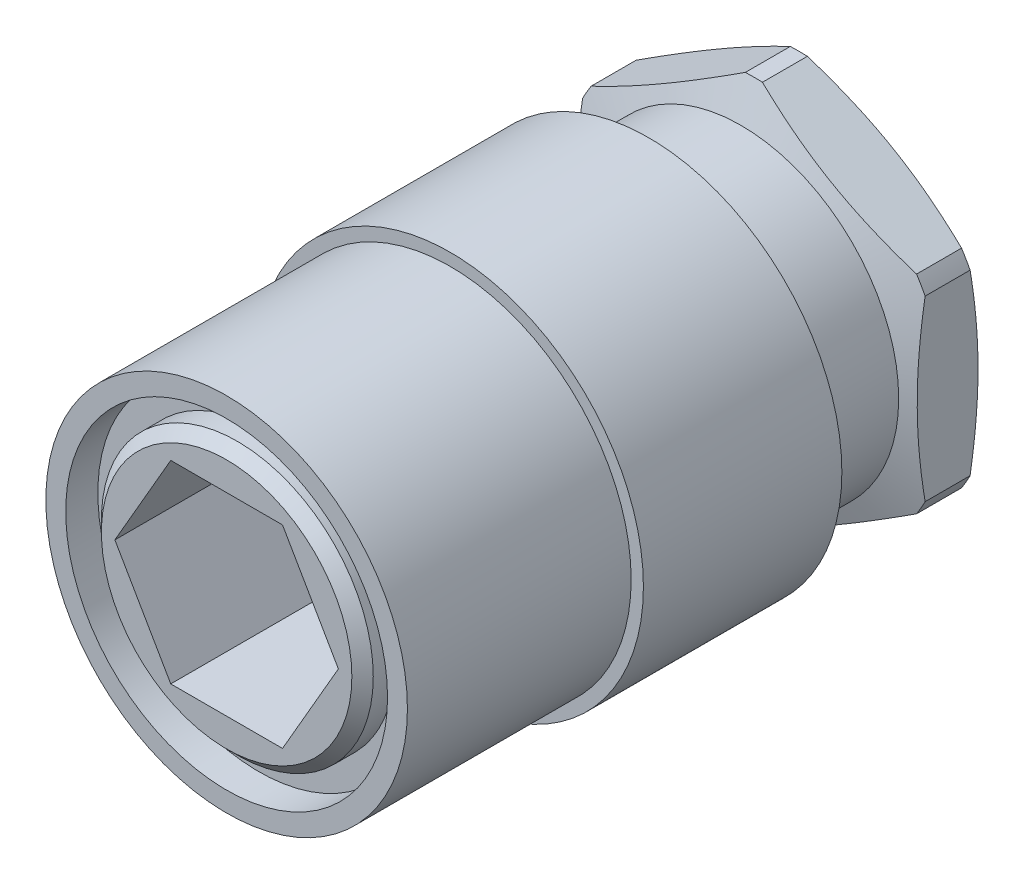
ISO-10303-21;
HEADER;
FILE_DESCRIPTION(('STEP AP214'),'2;1');
FILE_NAME('part.step','',(''),(''),'','','');
FILE_SCHEMA(('AUTOMOTIVE_DESIGN { 1 0 10303 214 1 1 1 1 }'));
ENDSEC;
DATA;
#1=APPLICATION_CONTEXT('core data for automotive mechanical design processes');
#2=APPLICATION_PROTOCOL_DEFINITION('international standard','automotive_design',2000,#1);
#3=PRODUCT_CONTEXT('',#1,'mechanical');
#4=PRODUCT('Part','Part','',(#3));
#5=PRODUCT_RELATED_PRODUCT_CATEGORY('part','',(#4));
#6=PRODUCT_DEFINITION_FORMATION('','',#4);
#7=PRODUCT_DEFINITION_CONTEXT('part definition',#1,'design');
#8=PRODUCT_DEFINITION('design','',#6,#7);
#9=PRODUCT_DEFINITION_SHAPE('','',#8);
#10=(LENGTH_UNIT() NAMED_UNIT(*) SI_UNIT(.MILLI.,.METRE.));
#11=(NAMED_UNIT(*) PLANE_ANGLE_UNIT() SI_UNIT($,.RADIAN.));
#12=(NAMED_UNIT(*) SI_UNIT($,.STERADIAN.) SOLID_ANGLE_UNIT());
#13=UNCERTAINTY_MEASURE_WITH_UNIT(LENGTH_MEASURE(1.E-05),#10,'distance_accuracy_value','');
#14=(GEOMETRIC_REPRESENTATION_CONTEXT(3) GLOBAL_UNCERTAINTY_ASSIGNED_CONTEXT((#13)) GLOBAL_UNIT_ASSIGNED_CONTEXT((#10,
#11,#12)) REPRESENTATION_CONTEXT('',''));
#15=CARTESIAN_POINT('',(0.,0.,0.));
#16=DIRECTION('',(0.,0.,1.));
#17=DIRECTION('',(1.,0.,0.));
#18=AXIS2_PLACEMENT_3D('',#15,#16,#17);
#19=CARTESIAN_POINT('',(0.,0.,-27.3304));
#20=DIRECTION('',(0.,0.,1.));
#21=DIRECTION('',(1.,0.,0.));
#22=AXIS2_PLACEMENT_3D('',#19,#20,#21);
#23=CYLINDRICAL_SURFACE('',#22,9.017);
#24=CARTESIAN_POINT('',(0.,0.,-19.7231));
#25=DIRECTION('',(0.,0.,-1.));
#26=DIRECTION('',(-1.,0.,0.));
#27=AXIS2_PLACEMENT_3D('',#24,#25,#26);
#28=CIRCLE('',#27,9.017);
#29=CARTESIAN_POINT('',(9.017,0.,-19.7231));
#30=VERTEX_POINT('',#29);
#31=EDGE_CURVE('E387',#30,#30,#28,.F.);
#32=CARTESIAN_POINT('',(0.,0.,-10.4521));
#33=DIRECTION('',(0.,0.,1.));
#34=DIRECTION('',(1.,0.,0.));
#35=AXIS2_PLACEMENT_3D('',#32,#33,#34);
#36=CIRCLE('',#35,9.017);
#37=CARTESIAN_POINT('',(9.017,0.,-10.4521));
#38=VERTEX_POINT('',#37);
#39=EDGE_CURVE('E211',#38,#38,#36,.T.);
#40=CARTESIAN_POINT('',(9.017,0.,-19.7231));
#41=CARTESIAN_POINT('',(9.017,0.,-19.6265270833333));
#42=CARTESIAN_POINT('',(9.017,0.,-19.5299541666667));
#43=CARTESIAN_POINT('',(9.017,0.,-19.3368083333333));
#44=CARTESIAN_POINT('',(9.017,0.,-19.2402354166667));
#45=CARTESIAN_POINT('',(9.017,0.,-19.0470895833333));
#46=CARTESIAN_POINT('',(9.017,0.,-18.9505166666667));
#47=CARTESIAN_POINT('',(9.017,0.,-18.7573708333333));
#48=CARTESIAN_POINT('',(9.017,0.,-18.6607979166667));
#49=CARTESIAN_POINT('',(9.017,0.,-18.4676520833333));
#50=CARTESIAN_POINT('',(9.017,0.,-18.3710791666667));
#51=CARTESIAN_POINT('',(9.017,0.,-18.1779333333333));
#52=CARTESIAN_POINT('',(9.017,0.,-18.0813604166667));
#53=CARTESIAN_POINT('',(9.017,0.,-17.8882145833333));
#54=CARTESIAN_POINT('',(9.017,0.,-17.7916416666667));
#55=CARTESIAN_POINT('',(9.017,0.,-17.5984958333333));
#56=CARTESIAN_POINT('',(9.017,0.,-17.5019229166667));
#57=CARTESIAN_POINT('',(9.017,0.,-17.3087770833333));
#58=CARTESIAN_POINT('',(9.017,0.,-17.2122041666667));
#59=CARTESIAN_POINT('',(9.017,0.,-17.0190583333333));
#60=CARTESIAN_POINT('',(9.017,0.,-16.9224854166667));
#61=CARTESIAN_POINT('',(9.017,0.,-16.7293395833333));
#62=CARTESIAN_POINT('',(9.017,0.,-16.6327666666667));
#63=CARTESIAN_POINT('',(9.017,0.,-16.4396208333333));
#64=CARTESIAN_POINT('',(9.017,0.,-16.3430479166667));
#65=CARTESIAN_POINT('',(9.017,0.,-16.1499020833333));
#66=CARTESIAN_POINT('',(9.017,0.,-16.0533291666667));
#67=CARTESIAN_POINT('',(9.017,0.,-15.8601833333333));
#68=CARTESIAN_POINT('',(9.017,0.,-15.7636104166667));
#69=CARTESIAN_POINT('',(9.017,0.,-15.5704645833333));
#70=CARTESIAN_POINT('',(9.017,0.,-15.4738916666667));
#71=CARTESIAN_POINT('',(9.017,0.,-15.2807458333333));
#72=CARTESIAN_POINT('',(9.017,0.,-15.1841729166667));
#73=CARTESIAN_POINT('',(9.017,0.,-14.9910270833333));
#74=CARTESIAN_POINT('',(9.017,0.,-14.8944541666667));
#75=CARTESIAN_POINT('',(9.017,0.,-14.7013083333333));
#76=CARTESIAN_POINT('',(9.017,0.,-14.6047354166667));
#77=CARTESIAN_POINT('',(9.017,0.,-14.4115895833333));
#78=CARTESIAN_POINT('',(9.017,0.,-14.3150166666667));
#79=CARTESIAN_POINT('',(9.017,0.,-14.1218708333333));
#80=CARTESIAN_POINT('',(9.017,0.,-14.0252979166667));
#81=CARTESIAN_POINT('',(9.017,0.,-13.8321520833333));
#82=CARTESIAN_POINT('',(9.017,0.,-13.7355791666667));
#83=CARTESIAN_POINT('',(9.017,0.,-13.5424333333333));
#84=CARTESIAN_POINT('',(9.017,0.,-13.4458604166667));
#85=CARTESIAN_POINT('',(9.017,0.,-13.2527145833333));
#86=CARTESIAN_POINT('',(9.017,0.,-13.1561416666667));
#87=CARTESIAN_POINT('',(9.017,0.,-12.9629958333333));
#88=CARTESIAN_POINT('',(9.017,0.,-12.8664229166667));
#89=CARTESIAN_POINT('',(9.017,0.,-12.6732770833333));
#90=CARTESIAN_POINT('',(9.017,0.,-12.5767041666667));
#91=CARTESIAN_POINT('',(9.017,0.,-12.3835583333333));
#92=CARTESIAN_POINT('',(9.017,0.,-12.2869854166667));
#93=CARTESIAN_POINT('',(9.017,0.,-12.0938395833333));
#94=CARTESIAN_POINT('',(9.017,0.,-11.9972666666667));
#95=CARTESIAN_POINT('',(9.017,0.,-11.8041208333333));
#96=CARTESIAN_POINT('',(9.017,0.,-11.7075479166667));
#97=CARTESIAN_POINT('',(9.017,0.,-11.5144020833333));
#98=CARTESIAN_POINT('',(9.017,0.,-11.4178291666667));
#99=CARTESIAN_POINT('',(9.017,0.,-11.2246833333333));
#100=CARTESIAN_POINT('',(9.017,0.,-11.1281104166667));
#101=CARTESIAN_POINT('',(9.017,0.,-10.9349645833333));
#102=CARTESIAN_POINT('',(9.017,0.,-10.8383916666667));
#103=CARTESIAN_POINT('',(9.017,0.,-10.6452458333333));
#104=CARTESIAN_POINT('',(9.017,0.,-10.5486729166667));
#105=CARTESIAN_POINT('',(9.017,0.,-10.4521));
#106=B_SPLINE_CURVE_WITH_KNOTS('',3,(#40,#41,#42,#43,#44,#45,#46,#47,#48,#49,#50,#51,#52,#53,
#54,#55,#56,#57,#58,#59,#60,#61,#62,#63,#64,#65,#66,#67,#68,#69,#70,#71,#72,#73,#74,#75,#76,#77,
#78,#79,#80,#81,#82,#83,#84,#85,#86,#87,#88,#89,#90,#91,#92,#93,#94,#95,#96,#97,#98,#99,#100,
#101,#102,#103,#104,#105),.UNSPECIFIED.,.F.,.F.,(4,2,2,2,2,2,2,2,2,2,2,2,2,2,2,2,2,2,2,2,2,2,2,
2,2,2,2,2,2,2,2,2,4),(0.,0.289718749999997,0.579437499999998,0.869156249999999,1.158875,
1.44859375,1.7383125,2.02803125,2.31775,2.60746875,2.8971875,3.18690625,3.476625,3.76634375,
4.0560625,4.34578125,4.6355,4.92521875,5.2149375,5.50465625,5.794375,6.08409375,6.3738125,
6.66353125,6.95325,7.24296875,7.5326875,7.82240625,8.112125,8.40184375,8.6915625,8.98128125,
9.271),.UNSPECIFIED.);
#107=EDGE_CURVE('BSEAM36',#30,#38,#106,.T.);
#108=ORIENTED_EDGE('',*,*,#31,.T.);
#109=ORIENTED_EDGE('',*,*,#39,.F.);
#110=ORIENTED_EDGE('',*,*,#107,.T.);
#111=ORIENTED_EDGE('',*,*,#107,.F.);
#112=EDGE_LOOP('',(#108,#110,#109,#111));
#113=FACE_BOUND('',#112,.T.);
#114=ADVANCED_FACE('F36',(#113),#23,.T.);
#115=DIRECTION('',(0.,0.,1.));
#116=VECTOR('',#115,1.);
#117=CARTESIAN_POINT('',(8.001,4.15815920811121,-27.3304));
#118=LINE('',#117,#116);
#119=CARTESIAN_POINT('',(8.001,4.15815920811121,-24.6293148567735));
#120=VERTEX_POINT('',#119);
#121=CARTESIAN_POINT('',(8.001,4.15815920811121,-26.7294851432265));
#122=VERTEX_POINT('',#121);
#123=EDGE_CURVE('E378',#120,#122,#118,.F.);
#124=ORIENTED_EDGE('',*,*,#123,.T.);
#125=CARTESIAN_POINT('',(0.,0.,-26.7294851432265));
#126=DIRECTION('',(0.,0.,1.));
#127=DIRECTION('',(1.,0.,0.));
#128=AXIS2_PLACEMENT_3D('',#125,#126,#127);
#129=CIRCLE('',#128,9.017);
#130=CARTESIAN_POINT('',(7.60157150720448,4.8499896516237,-26.7294851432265));
#131=VERTEX_POINT('',#130);
#132=EDGE_CURVE('E60',#122,#131,#129,.T.);
#133=ORIENTED_EDGE('',*,*,#132,.T.);
#134=DIRECTION('',(0.,0.,1.));
#135=VECTOR('',#134,1.);
#136=CARTESIAN_POINT('',(7.60157150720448,4.8499896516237,-27.3304));
#137=LINE('',#136,#135);
#138=CARTESIAN_POINT('',(7.60157150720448,4.8499896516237,-24.6293148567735));
#139=VERTEX_POINT('',#138);
#140=EDGE_CURVE('E376',#131,#139,#137,.T.);
#141=ORIENTED_EDGE('',*,*,#140,.T.);
#142=CARTESIAN_POINT('',(0.,0.,-24.6293148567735));
#143=DIRECTION('',(0.,0.,-1.));
#144=DIRECTION('',(-1.,0.,0.));
#145=AXIS2_PLACEMENT_3D('',#142,#143,#144);
#146=CIRCLE('',#145,9.017);
#147=EDGE_CURVE('E304',#139,#120,#146,.T.);
#148=ORIENTED_EDGE('',*,*,#147,.T.);
#149=EDGE_LOOP('',(#124,#133,#141,#148));
#150=FACE_BOUND('',#149,.T.);
#151=ADVANCED_FACE('F349',(#150),#23,.T.);
#152=DIRECTION('',(0.,0.,1.));
#153=VECTOR('',#152,1.);
#154=CARTESIAN_POINT('',(0.399428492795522,9.00814885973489,-27.3304));
#155=LINE('',#154,#153);
#156=CARTESIAN_POINT('',(0.399428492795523,9.0081488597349,-24.6293148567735));
#157=VERTEX_POINT('',#156);
#158=CARTESIAN_POINT('',(0.399428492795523,9.0081488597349,-26.7294851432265));
#159=VERTEX_POINT('',#158);
#160=EDGE_CURVE('E372',#157,#159,#155,.F.);
#161=ORIENTED_EDGE('',*,*,#160,.T.);
#162=CARTESIAN_POINT('',(0.,0.,-26.7294851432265));
#163=DIRECTION('',(0.,0.,1.));
#164=DIRECTION('',(1.,0.,0.));
#165=AXIS2_PLACEMENT_3D('',#162,#163,#164);
#166=CIRCLE('',#165,9.017);
#167=CARTESIAN_POINT('',(-0.399428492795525,9.0081488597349,-26.7294851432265));
#168=VERTEX_POINT('',#167);
#169=EDGE_CURVE('E373',#159,#168,#166,.T.);
#170=ORIENTED_EDGE('',*,*,#169,.T.);
#171=DIRECTION('',(0.,0.,1.));
#172=VECTOR('',#171,1.);
#173=CARTESIAN_POINT('',(-0.399428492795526,9.0081488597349,-27.3304));
#174=LINE('',#173,#172);
#175=CARTESIAN_POINT('',(-0.399428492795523,9.0081488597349,-24.6293148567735));
#176=VERTEX_POINT('',#175);
#177=EDGE_CURVE('E455',#168,#176,#174,.T.);
#178=ORIENTED_EDGE('',*,*,#177,.T.);
#179=CARTESIAN_POINT('',(0.,0.,-24.6293148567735));
#180=DIRECTION('',(0.,0.,-1.));
#181=DIRECTION('',(-1.,0.,0.));
#182=AXIS2_PLACEMENT_3D('',#179,#180,#181);
#183=CIRCLE('',#182,9.017);
#184=EDGE_CURVE('E324',#176,#157,#183,.T.);
#185=ORIENTED_EDGE('',*,*,#184,.T.);
#186=EDGE_LOOP('',(#161,#170,#178,#185));
#187=FACE_BOUND('',#186,.T.);
#188=ADVANCED_FACE('F352',(#187),#23,.T.);
#189=DIRECTION('',(0.,0.,1.));
#190=VECTOR('',#189,1.);
#191=CARTESIAN_POINT('',(-7.60157150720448,4.8499896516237,-27.3304));
#192=LINE('',#191,#190);
#193=CARTESIAN_POINT('',(-7.60157150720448,4.8499896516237,-24.6293148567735));
#194=VERTEX_POINT('',#193);
#195=CARTESIAN_POINT('',(-7.60157150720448,4.8499896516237,-26.7294851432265));
#196=VERTEX_POINT('',#195);
#197=EDGE_CURVE('E380',#194,#196,#192,.F.);
#198=ORIENTED_EDGE('',*,*,#197,.T.);
#199=CARTESIAN_POINT('',(0.,0.,-26.7294851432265));
#200=DIRECTION('',(0.,0.,1.));
#201=DIRECTION('',(1.,0.,0.));
#202=AXIS2_PLACEMENT_3D('',#199,#200,#201);
#203=CIRCLE('',#202,9.017);
#204=CARTESIAN_POINT('',(-8.00099999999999,4.15815920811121,-26.7294851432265));
#205=VERTEX_POINT('',#204);
#206=EDGE_CURVE('E459',#196,#205,#203,.T.);
#207=ORIENTED_EDGE('',*,*,#206,.T.);
#208=DIRECTION('',(0.,0.,1.));
#209=VECTOR('',#208,1.);
#210=CARTESIAN_POINT('',(-8.00099999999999,4.15815920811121,-27.3304));
#211=LINE('',#210,#209);
#212=CARTESIAN_POINT('',(-8.00099999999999,4.15815920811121,-24.6293148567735));
#213=VERTEX_POINT('',#212);
#214=EDGE_CURVE('E450',#205,#213,#211,.T.);
#215=ORIENTED_EDGE('',*,*,#214,.T.);
#216=CARTESIAN_POINT('',(0.,0.,-24.6293148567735));
#217=DIRECTION('',(0.,0.,-1.));
#218=DIRECTION('',(-1.,0.,0.));
#219=AXIS2_PLACEMENT_3D('',#216,#217,#218);
#220=CIRCLE('',#219,9.017);
#221=EDGE_CURVE('E333',#213,#194,#220,.T.);
#222=ORIENTED_EDGE('',*,*,#221,.T.);
#223=EDGE_LOOP('',(#198,#207,#215,#222));
#224=FACE_BOUND('',#223,.T.);
#225=ADVANCED_FACE('F362',(#224),#23,.T.);
#226=DIRECTION('',(0.,0.,1.));
#227=VECTOR('',#226,1.);
#228=CARTESIAN_POINT('',(-8.001,-4.15815920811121,-27.3304));
#229=LINE('',#228,#227);
#230=CARTESIAN_POINT('',(-8.001,-4.15815920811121,-24.6293148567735));
#231=VERTEX_POINT('',#230);
#232=CARTESIAN_POINT('',(-8.001,-4.15815920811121,-26.7294851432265));
#233=VERTEX_POINT('',#232);
#234=EDGE_CURVE('E452',#231,#233,#229,.F.);
#235=ORIENTED_EDGE('',*,*,#234,.T.);
#236=CARTESIAN_POINT('',(0.,0.,-26.7294851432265));
#237=DIRECTION('',(0.,0.,1.));
#238=DIRECTION('',(1.,0.,0.));
#239=AXIS2_PLACEMENT_3D('',#236,#237,#238);
#240=CIRCLE('',#239,9.017);
#241=CARTESIAN_POINT('',(-7.60157150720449,-4.84998965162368,-26.7294851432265));
#242=VERTEX_POINT('',#241);
#243=EDGE_CURVE('E284',#233,#242,#240,.T.);
#244=ORIENTED_EDGE('',*,*,#243,.T.);
#245=DIRECTION('',(0.,0.,1.));
#246=VECTOR('',#245,1.);
#247=CARTESIAN_POINT('',(-7.60157150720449,-4.84998965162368,-27.3304));
#248=LINE('',#247,#246);
#249=CARTESIAN_POINT('',(-7.60157150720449,-4.84998965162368,-24.6293148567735));
#250=VERTEX_POINT('',#249);
#251=EDGE_CURVE('E445',#242,#250,#248,.T.);
#252=ORIENTED_EDGE('',*,*,#251,.T.);
#253=CARTESIAN_POINT('',(0.,0.,-24.6293148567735));
#254=DIRECTION('',(0.,0.,-1.));
#255=DIRECTION('',(-1.,0.,0.));
#256=AXIS2_PLACEMENT_3D('',#253,#254,#255);
#257=CIRCLE('',#256,9.017);
#258=EDGE_CURVE('E315',#250,#231,#257,.T.);
#259=ORIENTED_EDGE('',*,*,#258,.T.);
#260=EDGE_LOOP('',(#235,#244,#252,#259));
#261=FACE_BOUND('',#260,.T.);
#262=ADVANCED_FACE('F367',(#261),#23,.T.);
#263=DIRECTION('',(0.,0.,1.));
#264=VECTOR('',#263,1.);
#265=CARTESIAN_POINT('',(-0.399428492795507,-9.0081488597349,-27.3304));
#266=LINE('',#265,#264);
#267=CARTESIAN_POINT('',(-0.399428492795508,-9.0081488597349,-24.6293148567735));
#268=VERTEX_POINT('',#267);
#269=CARTESIAN_POINT('',(-0.399428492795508,-9.0081488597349,-26.7294851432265));
#270=VERTEX_POINT('',#269);
#271=EDGE_CURVE('E447',#268,#270,#266,.F.);
#272=ORIENTED_EDGE('',*,*,#271,.T.);
#273=CARTESIAN_POINT('',(0.,0.,-26.7294851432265));
#274=DIRECTION('',(0.,0.,1.));
#275=DIRECTION('',(1.,0.,0.));
#276=AXIS2_PLACEMENT_3D('',#273,#274,#275);
#277=CIRCLE('',#276,9.017);
#278=CARTESIAN_POINT('',(0.399428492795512,-9.0081488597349,-26.7294851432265));
#279=VERTEX_POINT('',#278);
#280=EDGE_CURVE('E463',#270,#279,#277,.T.);
#281=ORIENTED_EDGE('',*,*,#280,.T.);
#282=DIRECTION('',(0.,0.,1.));
#283=VECTOR('',#282,1.);
#284=CARTESIAN_POINT('',(0.399428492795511,-9.0081488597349,-27.3304));
#285=LINE('',#284,#283);
#286=CARTESIAN_POINT('',(0.399428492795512,-9.0081488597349,-24.6293148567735));
#287=VERTEX_POINT('',#286);
#288=EDGE_CURVE('E388',#279,#287,#285,.T.);
#289=ORIENTED_EDGE('',*,*,#288,.T.);
#290=CARTESIAN_POINT('',(0.,0.,-24.6293148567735));
#291=DIRECTION('',(0.,0.,-1.));
#292=DIRECTION('',(-1.,0.,0.));
#293=AXIS2_PLACEMENT_3D('',#290,#291,#292);
#294=CIRCLE('',#293,9.017);
#295=EDGE_CURVE('E305',#287,#268,#294,.T.);
#296=ORIENTED_EDGE('',*,*,#295,.T.);
#297=EDGE_LOOP('',(#272,#281,#289,#296));
#298=FACE_BOUND('',#297,.T.);
#299=ADVANCED_FACE('F729',(#298),#23,.T.);
#300=DIRECTION('',(0.,0.,1.));
#301=VECTOR('',#300,1.);
#302=CARTESIAN_POINT('',(7.60157150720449,-4.84998965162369,-27.3304));
#303=LINE('',#302,#301);
#304=CARTESIAN_POINT('',(7.60157150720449,-4.84998965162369,-24.6293148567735));
#305=VERTEX_POINT('',#304);
#306=CARTESIAN_POINT('',(7.60157150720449,-4.84998965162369,-26.7294851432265));
#307=VERTEX_POINT('',#306);
#308=EDGE_CURVE('E443',#305,#307,#303,.F.);
#309=ORIENTED_EDGE('',*,*,#308,.T.);
#310=CARTESIAN_POINT('',(0.,0.,-26.7294851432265));
#311=DIRECTION('',(0.,0.,1.));
#312=DIRECTION('',(1.,0.,0.));
#313=AXIS2_PLACEMENT_3D('',#310,#311,#312);
#314=CIRCLE('',#313,9.017);
#315=CARTESIAN_POINT('',(8.001,-4.15815920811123,-26.7294851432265));
#316=VERTEX_POINT('',#315);
#317=EDGE_CURVE('E223',#307,#316,#314,.T.);
#318=ORIENTED_EDGE('',*,*,#317,.T.);
#319=DIRECTION('',(0.,0.,1.));
#320=VECTOR('',#319,1.);
#321=CARTESIAN_POINT('',(8.001,-4.15815920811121,-27.3304));
#322=LINE('',#321,#320);
#323=CARTESIAN_POINT('',(8.001,-4.1581592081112,-24.6293148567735));
#324=VERTEX_POINT('',#323);
#325=EDGE_CURVE('E375',#316,#324,#322,.T.);
#326=ORIENTED_EDGE('',*,*,#325,.T.);
#327=CARTESIAN_POINT('',(0.,0.,-24.6293148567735));
#328=DIRECTION('',(0.,0.,-1.));
#329=DIRECTION('',(-1.,0.,0.));
#330=AXIS2_PLACEMENT_3D('',#327,#328,#329);
#331=CIRCLE('',#330,9.017);
#332=EDGE_CURVE('E386',#324,#305,#331,.T.);
#333=ORIENTED_EDGE('',*,*,#332,.T.);
#334=EDGE_LOOP('',(#309,#318,#326,#333));
#335=FACE_BOUND('',#334,.T.);
#336=ADVANCED_FACE('F357',(#335),#23,.T.);
#337=CARTESIAN_POINT('',(8.001,-4.61937950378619,-24.0284));
#338=DIRECTION('',(0.5,-0.866025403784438,0.));
#339=DIRECTION('',(0.866025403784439,0.5,0.));
#340=AXIS2_PLACEMENT_3D('',#337,#338,#339);
#341=PLANE('',#340);
#342=ORIENTED_EDGE('',*,*,#288,.F.);
#343=CARTESIAN_POINT('',(0.399228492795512,-9.00826432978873,-26.7294463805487));
#344=CARTESIAN_POINT('',(0.697739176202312,-8.83591910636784,-26.7873360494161));
#345=CARTESIAN_POINT('',(0.997124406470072,-8.66306896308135,-26.8396746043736));
#346=CARTESIAN_POINT('',(1.59753705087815,-8.31642056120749,-26.9313664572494));
#347=CARTESIAN_POINT('',(1.8985652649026,-8.1426218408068,-26.9707127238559));
#348=CARTESIAN_POINT('',(2.4994606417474,-7.79569473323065,-27.0342194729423));
#349=CARTESIAN_POINT('',(2.79931830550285,-7.62257183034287,-27.0584969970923));
#350=CARTESIAN_POINT('',(3.39961742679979,-7.27598897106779,-27.0910246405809));
#351=CARTESIAN_POINT('',(3.7000587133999,-7.10252911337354,-27.099278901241));
#352=CARTESIAN_POINT('',(4.30094128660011,-6.75560939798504,-27.099278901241));
#353=CARTESIAN_POINT('',(4.60138257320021,-6.58214954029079,-27.0910246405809));
#354=CARTESIAN_POINT('',(5.20168169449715,-6.23556668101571,-27.0584969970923));
#355=CARTESIAN_POINT('',(5.5015393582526,-6.06244377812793,-27.0342194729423));
#356=CARTESIAN_POINT('',(6.1024347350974,-5.71551667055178,-26.9707127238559));
#357=CARTESIAN_POINT('',(6.40346294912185,-5.54171795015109,-26.9313664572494));
#358=CARTESIAN_POINT('',(7.00387559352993,-5.19506954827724,-26.8396746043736));
#359=CARTESIAN_POINT('',(7.30326082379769,-5.02221940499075,-26.7873360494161));
#360=CARTESIAN_POINT('',(7.60177150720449,-4.84987418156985,-26.7294463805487));
#361=B_SPLINE_CURVE_WITH_KNOTS('',3,(#343,#344,#345,#346,#347,#348,#349,#350,#351,#352,#353,
#354,#355,#356,#357,#358,#359,#360),.UNSPECIFIED.,.F.,.F.,(4,2,2,2,2,2,2,2,4),(0.,
1.04862351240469,2.09781360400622,3.13874897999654,4.17941528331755,5.22008158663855,
6.26101696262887,7.3102070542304,8.35883056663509),.UNSPECIFIED.);
#362=EDGE_CURVE('E235',#279,#307,#361,.T.);
#363=ORIENTED_EDGE('',*,*,#362,.T.);
#364=ORIENTED_EDGE('',*,*,#308,.F.);
#365=CARTESIAN_POINT('',(7.60177150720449,-4.84987418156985,-24.6293536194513));
#366=CARTESIAN_POINT('',(7.30326082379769,-5.02221940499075,-24.5714639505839));
#367=CARTESIAN_POINT('',(7.00387559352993,-5.19506954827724,-24.5191253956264));
#368=CARTESIAN_POINT('',(6.40346294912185,-5.54171795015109,-24.4274335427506));
#369=CARTESIAN_POINT('',(6.1024347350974,-5.71551667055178,-24.3880872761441));
#370=CARTESIAN_POINT('',(5.5015393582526,-6.06244377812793,-24.3245805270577));
#371=CARTESIAN_POINT('',(5.20168169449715,-6.23556668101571,-24.3003030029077));
#372=CARTESIAN_POINT('',(4.60138257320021,-6.58214954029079,-24.2677753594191));
#373=CARTESIAN_POINT('',(4.30094128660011,-6.75560939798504,-24.259521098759));
#374=CARTESIAN_POINT('',(3.7000587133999,-7.10252911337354,-24.259521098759));
#375=CARTESIAN_POINT('',(3.39961742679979,-7.27598897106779,-24.2677753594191));
#376=CARTESIAN_POINT('',(2.79931830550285,-7.62257183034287,-24.3003030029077));
#377=CARTESIAN_POINT('',(2.4994606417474,-7.79569473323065,-24.3245805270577));
#378=CARTESIAN_POINT('',(1.8985652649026,-8.1426218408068,-24.3880872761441));
#379=CARTESIAN_POINT('',(1.59753705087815,-8.31642056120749,-24.4274335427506));
#380=CARTESIAN_POINT('',(0.997124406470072,-8.66306896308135,-24.5191253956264));
#381=CARTESIAN_POINT('',(0.697739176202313,-8.83591910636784,-24.5714639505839));
#382=CARTESIAN_POINT('',(0.399228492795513,-9.00826432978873,-24.6293536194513));
#383=B_SPLINE_CURVE_WITH_KNOTS('',3,(#365,#366,#367,#368,#369,#370,#371,#372,#373,#374,#375,
#376,#377,#378,#379,#380,#381,#382),.UNSPECIFIED.,.F.,.F.,(4,2,2,2,2,2,2,2,4),(0.,
1.04862351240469,2.09781360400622,3.13874897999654,4.17941528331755,5.22008158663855,
6.26101696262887,7.3102070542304,8.35883056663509),.UNSPECIFIED.);
#384=EDGE_CURVE('E474',#305,#287,#383,.T.);
#385=ORIENTED_EDGE('',*,*,#384,.T.);
#386=EDGE_LOOP('',(#342,#363,#364,#385));
#387=FACE_BOUND('',#386,.T.);
#388=ADVANCED_FACE('F291',(#387),#341,.T.);
#389=CARTESIAN_POINT('',(0.,-9.23875900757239,-24.0284));
#390=DIRECTION('',(-0.5,-0.866025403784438,0.));
#391=DIRECTION('',(0.866025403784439,-0.5,0.));
#392=AXIS2_PLACEMENT_3D('',#389,#390,#391);
#393=PLANE('',#392);
#394=ORIENTED_EDGE('',*,*,#251,.F.);
#395=CARTESIAN_POINT('',(-7.60177150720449,-4.84987418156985,-26.7294463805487));
#396=CARTESIAN_POINT('',(-7.30326082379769,-5.02221940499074,-26.7873360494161));
#397=CARTESIAN_POINT('',(-7.00387559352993,-5.19506954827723,-26.8396746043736));
#398=CARTESIAN_POINT('',(-6.40346294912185,-5.54171795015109,-26.9313664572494));
#399=CARTESIAN_POINT('',(-6.1024347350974,-5.71551667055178,-26.9707127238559));
#400=CARTESIAN_POINT('',(-5.5015393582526,-6.06244377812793,-27.0342194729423));
#401=CARTESIAN_POINT('',(-5.20168169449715,-6.23556668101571,-27.0584969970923));
#402=CARTESIAN_POINT('',(-4.60138257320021,-6.58214954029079,-27.0910246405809));
#403=CARTESIAN_POINT('',(-4.30094128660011,-6.75560939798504,-27.099278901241));
#404=CARTESIAN_POINT('',(-3.70005871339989,-7.10252911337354,-27.099278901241));
#405=CARTESIAN_POINT('',(-3.39961742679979,-7.27598897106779,-27.0910246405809));
#406=CARTESIAN_POINT('',(-2.79931830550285,-7.62257183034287,-27.0584969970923));
#407=CARTESIAN_POINT('',(-2.4994606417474,-7.79569473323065,-27.0342194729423));
#408=CARTESIAN_POINT('',(-1.8985652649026,-8.1426218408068,-26.9707127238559));
#409=CARTESIAN_POINT('',(-1.59753705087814,-8.31642056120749,-26.9313664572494));
#410=CARTESIAN_POINT('',(-0.997124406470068,-8.66306896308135,-26.8396746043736));
#411=CARTESIAN_POINT('',(-0.697739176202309,-8.83591910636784,-26.7873360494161));
#412=CARTESIAN_POINT('',(-0.399228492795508,-9.00826432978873,-26.7294463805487));
#413=B_SPLINE_CURVE_WITH_KNOTS('',3,(#395,#396,#397,#398,#399,#400,#401,#402,#403,#404,#405,
#406,#407,#408,#409,#410,#411,#412),.UNSPECIFIED.,.F.,.F.,(4,2,2,2,2,2,2,2,4),(0.,
1.04862351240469,2.09781360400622,3.13874897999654,4.17941528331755,5.22008158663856,
6.26101696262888,7.31020705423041,8.3588305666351),.UNSPECIFIED.);
#414=EDGE_CURVE('E277',#242,#270,#413,.T.);
#415=ORIENTED_EDGE('',*,*,#414,.T.);
#416=ORIENTED_EDGE('',*,*,#271,.F.);
#417=CARTESIAN_POINT('',(-0.399228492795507,-9.00826432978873,-24.6293536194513));
#418=CARTESIAN_POINT('',(-0.697739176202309,-8.83591910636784,-24.5714639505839));
#419=CARTESIAN_POINT('',(-0.997124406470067,-8.66306896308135,-24.5191253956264));
#420=CARTESIAN_POINT('',(-1.59753705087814,-8.31642056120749,-24.4274335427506));
#421=CARTESIAN_POINT('',(-1.8985652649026,-8.1426218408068,-24.3880872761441));
#422=CARTESIAN_POINT('',(-2.4994606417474,-7.79569473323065,-24.3245805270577));
#423=CARTESIAN_POINT('',(-2.79931830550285,-7.62257183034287,-24.3003030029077));
#424=CARTESIAN_POINT('',(-3.39961742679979,-7.27598897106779,-24.2677753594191));
#425=CARTESIAN_POINT('',(-3.70005871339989,-7.10252911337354,-24.259521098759));
#426=CARTESIAN_POINT('',(-4.3009412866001,-6.75560939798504,-24.259521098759));
#427=CARTESIAN_POINT('',(-4.60138257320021,-6.58214954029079,-24.2677753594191));
#428=CARTESIAN_POINT('',(-5.20168169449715,-6.23556668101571,-24.3003030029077));
#429=CARTESIAN_POINT('',(-5.5015393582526,-6.06244377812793,-24.3245805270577));
#430=CARTESIAN_POINT('',(-6.1024347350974,-5.71551667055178,-24.3880872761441));
#431=CARTESIAN_POINT('',(-6.40346294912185,-5.54171795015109,-24.4274335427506));
#432=CARTESIAN_POINT('',(-7.00387559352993,-5.19506954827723,-24.5191253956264));
#433=CARTESIAN_POINT('',(-7.30326082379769,-5.02221940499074,-24.5714639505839));
#434=CARTESIAN_POINT('',(-7.60177150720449,-4.84987418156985,-24.6293536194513));
#435=B_SPLINE_CURVE_WITH_KNOTS('',3,(#417,#418,#419,#420,#421,#422,#423,#424,#425,#426,#427,
#428,#429,#430,#431,#432,#433,#434),.UNSPECIFIED.,.F.,.F.,(4,2,2,2,2,2,2,2,4),(0.,
1.04862351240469,2.09781360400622,3.13874897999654,4.17941528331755,5.22008158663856,
6.26101696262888,7.31020705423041,8.3588305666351),.UNSPECIFIED.);
#436=EDGE_CURVE('E297',#268,#250,#435,.T.);
#437=ORIENTED_EDGE('',*,*,#436,.T.);
#438=EDGE_LOOP('',(#394,#415,#416,#437));
#439=FACE_BOUND('',#438,.T.);
#440=ADVANCED_FACE('F286',(#439),#393,.T.);
#441=CARTESIAN_POINT('',(-8.001,-4.61937950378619,-24.0284));
#442=DIRECTION('',(-1.,0.,0.));
#443=DIRECTION('',(0.,-1.,0.));
#444=AXIS2_PLACEMENT_3D('',#441,#442,#443);
#445=PLANE('',#444);
#446=ORIENTED_EDGE('',*,*,#214,.F.);
#447=CARTESIAN_POINT('',(-8.001,-11.7689898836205,-24.8316962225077));
#448=CARTESIAN_POINT('',(-8.001,-11.4118433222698,-24.9391648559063));
#449=CARTESIAN_POINT('',(-8.001,-11.0542795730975,-25.0452744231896));
#450=CARTESIAN_POINT('',(-8.001,-10.3381067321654,-25.2540227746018));
#451=CARTESIAN_POINT('',(-8.001,-9.97949754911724,-25.3566612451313));
#452=CARTESIAN_POINT('',(-8.001,-9.26029441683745,-25.5579169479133));
#453=CARTESIAN_POINT('',(-8.001,-8.89969783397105,-25.6565248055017));
#454=CARTESIAN_POINT('',(-8.001,-8.17709905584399,-25.848440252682));
#455=CARTESIAN_POINT('',(-8.001,-7.81509688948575,-25.9417479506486));
#456=CARTESIAN_POINT('',(-8.001,-7.09417799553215,-26.1205867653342));
#457=CARTESIAN_POINT('',(-8.001,-6.73528260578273,-26.2062034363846));
#458=CARTESIAN_POINT('',(-8.001,-6.01565552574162,-26.3694297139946));
#459=CARTESIAN_POINT('',(-8.001,-5.65492380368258,-26.4470391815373));
#460=CARTESIAN_POINT('',(-8.001,-4.93164103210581,-26.592288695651));
#461=CARTESIAN_POINT('',(-8.001,-4.56909105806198,-26.6599340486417));
#462=CARTESIAN_POINT('',(-8.001,-3.84191809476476,-26.7830719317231));
#463=CARTESIAN_POINT('',(-8.001,-3.47729518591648,-26.8385649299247));
#464=CARTESIAN_POINT('',(-8.001,-2.78750400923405,-26.9295645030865));
#465=CARTESIAN_POINT('',(-8.001,-2.46254233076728,-26.9666225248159));
#466=CARTESIAN_POINT('',(-8.001,-1.81139194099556,-27.0277749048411));
#467=CARTESIAN_POINT('',(-8.001,-1.48520326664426,-27.0518696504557));
#468=CARTESIAN_POINT('',(-8.001,-0.832251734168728,-27.0859271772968));
#469=CARTESIAN_POINT('',(-8.001,-0.505489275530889,-27.095897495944));
#470=CARTESIAN_POINT('',(-8.001,0.148156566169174,-27.1012083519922));
#471=CARTESIAN_POINT('',(-8.001,0.475039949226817,-27.0965488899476));
#472=CARTESIAN_POINT('',(-8.001,1.12991070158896,-27.0727878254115));
#473=CARTESIAN_POINT('',(-8.001,1.45789541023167,-27.0536140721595));
#474=CARTESIAN_POINT('',(-8.001,2.1127803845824,-27.0017069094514));
#475=CARTESIAN_POINT('',(-8.00099999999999,2.43968062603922,-26.9689731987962));
#476=CARTESIAN_POINT('',(-8.00099999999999,3.09226964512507,-26.8913733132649));
#477=CARTESIAN_POINT('',(-8.00099999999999,3.4179573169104,-26.8464979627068));
#478=CARTESIAN_POINT('',(-8.00099999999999,4.06770520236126,-26.7462939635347));
#479=CARTESIAN_POINT('',(-8.00099999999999,4.39176540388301,-26.6909652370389));
#480=CARTESIAN_POINT('',(-8.00099999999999,5.02897687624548,-26.5732166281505));
#481=CARTESIAN_POINT('',(-8.00099999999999,5.34217454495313,-26.5110455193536));
#482=CARTESIAN_POINT('',(-8.00099999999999,5.96712055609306,-26.3797659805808));
#483=CARTESIAN_POINT('',(-8.00099999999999,6.27886882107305,-26.3106571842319));
#484=CARTESIAN_POINT('',(-8.00099999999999,6.90109193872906,-26.1666765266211));
#485=CARTESIAN_POINT('',(-8.00099999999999,7.21156651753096,-26.0918034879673));
#486=CARTESIAN_POINT('',(-8.00099999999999,7.83131974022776,-25.937301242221));
#487=CARTESIAN_POINT('',(-8.00099999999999,8.14059840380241,-25.8576721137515));
#488=CARTESIAN_POINT('',(-8.00099999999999,8.75838676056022,-25.6944020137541));
#489=CARTESIAN_POINT('',(-8.00099999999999,9.06689552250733,-25.6107575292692));
#490=CARTESIAN_POINT('',(-8.00099999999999,9.68300513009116,-25.4401836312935));
#491=CARTESIAN_POINT('',(-8.00099999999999,9.99060596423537,-25.3532541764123));
#492=CARTESIAN_POINT('',(-8.00099999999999,10.912152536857,-25.0884014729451));
#493=CARTESIAN_POINT('',(-8.00099999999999,11.5249236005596,-24.9063920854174));
#494=CARTESIAN_POINT('',(-8.00099999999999,12.7410773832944,-24.5368176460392));
#495=CARTESIAN_POINT('',(-8.00099999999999,13.3444870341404,-24.3493405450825));
#496=CARTESIAN_POINT('',(-8.00099999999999,14.5495866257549,-23.9688780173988));
#497=CARTESIAN_POINT('',(-8.00099999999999,15.1512765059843,-23.7758923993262));
#498=CARTESIAN_POINT('',(-8.00099999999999,16.3515428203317,-23.3863924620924));
#499=CARTESIAN_POINT('',(-8.00099999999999,16.9501231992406,-23.1898902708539));
#500=CARTESIAN_POINT('',(-8.00099999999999,17.8471966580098,-22.8928026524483));
#501=CARTESIAN_POINT('',(-8.00099999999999,18.1460782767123,-22.7933877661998));
#502=CARTESIAN_POINT('',(-8.00099999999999,18.7436097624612,-22.5938663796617));
#503=CARTESIAN_POINT('',(-8.00099999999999,19.0422596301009,-22.4937598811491));
#504=CARTESIAN_POINT('',(-8.00099999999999,19.3408080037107,-22.3933516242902));
#505=B_SPLINE_CURVE_WITH_KNOTS('',3,(#447,#448,#449,#450,#451,#452,#453,#454,#455,#456,#457,
#458,#459,#460,#461,#462,#463,#464,#465,#466,#467,#468,#469,#470,#471,#472,#473,#474,#475,#476,
#477,#478,#479,#480,#481,#482,#483,#484,#485,#486,#487,#488,#489,#490,#491,#492,#493,#494,#495,
#496,#497,#498,#499,#500,#501,#502,#503,#504),.UNSPECIFIED.,.F.,.F.,(4,2,2,2,2,2,2,2,2,2,2,2,2,
2,2,2,2,2,2,2,2,2,2,2,2,2,2,2,4),(0.,1.11890524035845,2.23791130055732,3.35938697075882,
4.48083970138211,5.58766577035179,6.694511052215,7.80076473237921,8.90697579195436,
9.88795120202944,10.8688973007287,11.8493197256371,12.8297421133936,13.8150704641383,
14.8004207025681,15.7865176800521,16.7726220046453,17.7304555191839,18.6883396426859,
19.646419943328,20.6044844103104,21.5634029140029,22.5223335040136,24.4399423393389,
26.3355006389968,28.2311248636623,30.1211412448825,31.0660860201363,32.0110283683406),.UNSPECIFIED.);
#506=EDGE_CURVE('E812',#205,#233,#505,.F.);
#507=ORIENTED_EDGE('',*,*,#506,.T.);
#508=ORIENTED_EDGE('',*,*,#234,.F.);
#509=CARTESIAN_POINT('',(-8.001,-11.7689898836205,-26.5271037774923));
#510=CARTESIAN_POINT('',(-8.001,-11.4118433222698,-26.4196351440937));
#511=CARTESIAN_POINT('',(-8.001,-11.0542795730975,-26.3135255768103));
#512=CARTESIAN_POINT('',(-8.001,-10.3381067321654,-26.1047772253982));
#513=CARTESIAN_POINT('',(-8.001,-9.97949754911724,-26.0021387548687));
#514=CARTESIAN_POINT('',(-8.001,-9.26029441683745,-25.8008830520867));
#515=CARTESIAN_POINT('',(-8.001,-8.89969783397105,-25.7022751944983));
#516=CARTESIAN_POINT('',(-8.001,-8.17709905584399,-25.510359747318));
#517=CARTESIAN_POINT('',(-8.001,-7.81509688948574,-25.4170520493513));
#518=CARTESIAN_POINT('',(-8.001,-7.09417799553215,-25.2382132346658));
#519=CARTESIAN_POINT('',(-8.001,-6.73528260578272,-25.1525965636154));
#520=CARTESIAN_POINT('',(-8.001,-6.01565552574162,-24.9893702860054));
#521=CARTESIAN_POINT('',(-8.001,-5.65492380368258,-24.9117608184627));
#522=CARTESIAN_POINT('',(-8.001,-4.93164103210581,-24.766511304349));
#523=CARTESIAN_POINT('',(-8.001,-4.56909105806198,-24.6988659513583));
#524=CARTESIAN_POINT('',(-8.001,-3.84191809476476,-24.5757280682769));
#525=CARTESIAN_POINT('',(-8.001,-3.47729518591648,-24.5202350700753));
#526=CARTESIAN_POINT('',(-8.001,-2.78750400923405,-24.4292354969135));
#527=CARTESIAN_POINT('',(-8.001,-2.46254233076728,-24.392177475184));
#528=CARTESIAN_POINT('',(-8.001,-1.81139194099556,-24.3310250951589));
#529=CARTESIAN_POINT('',(-8.001,-1.48520326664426,-24.3069303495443));
#530=CARTESIAN_POINT('',(-8.001,-0.832251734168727,-24.2728728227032));
#531=CARTESIAN_POINT('',(-8.001,-0.505489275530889,-24.262902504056));
#532=CARTESIAN_POINT('',(-8.001,0.148156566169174,-24.2575916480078));
#533=CARTESIAN_POINT('',(-8.001,0.475039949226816,-24.2622511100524));
#534=CARTESIAN_POINT('',(-8.001,1.12991070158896,-24.2860121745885));
#535=CARTESIAN_POINT('',(-8.001,1.45789541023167,-24.3051859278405));
#536=CARTESIAN_POINT('',(-8.001,2.1127803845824,-24.3570930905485));
#537=CARTESIAN_POINT('',(-8.00099999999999,2.43968062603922,-24.3898268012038));
#538=CARTESIAN_POINT('',(-8.00099999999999,3.09226964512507,-24.4674266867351));
#539=CARTESIAN_POINT('',(-8.00099999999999,3.4179573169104,-24.5123020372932));
#540=CARTESIAN_POINT('',(-8.00099999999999,4.06770520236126,-24.6125060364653));
#541=CARTESIAN_POINT('',(-8.00099999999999,4.39176540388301,-24.6678347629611));
#542=CARTESIAN_POINT('',(-8.00099999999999,5.02897687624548,-24.7855833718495));
#543=CARTESIAN_POINT('',(-8.00099999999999,5.34217454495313,-24.8477544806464));
#544=CARTESIAN_POINT('',(-8.00099999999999,5.96712055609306,-24.9790340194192));
#545=CARTESIAN_POINT('',(-8.00099999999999,6.27886882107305,-25.048142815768));
#546=CARTESIAN_POINT('',(-8.00099999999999,6.90109193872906,-25.1921234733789));
#547=CARTESIAN_POINT('',(-8.00099999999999,7.21156651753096,-25.2669965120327));
#548=CARTESIAN_POINT('',(-8.00099999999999,7.83131974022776,-25.421498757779));
#549=CARTESIAN_POINT('',(-8.00099999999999,8.14059840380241,-25.5011278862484));
#550=CARTESIAN_POINT('',(-8.00099999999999,8.75838676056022,-25.6643979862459));
#551=CARTESIAN_POINT('',(-8.00099999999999,9.06689552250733,-25.7480424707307));
#552=CARTESIAN_POINT('',(-8.00099999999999,9.68300513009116,-25.9186163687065));
#553=CARTESIAN_POINT('',(-8.00099999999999,9.99060596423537,-26.0055458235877));
#554=CARTESIAN_POINT('',(-8.00099999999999,10.912152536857,-26.2703985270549));
#555=CARTESIAN_POINT('',(-8.00099999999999,11.5249236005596,-26.4524079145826));
#556=CARTESIAN_POINT('',(-8.00099999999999,12.7410773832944,-26.8219823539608));
#557=CARTESIAN_POINT('',(-8.00099999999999,13.3444870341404,-27.0094594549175));
#558=CARTESIAN_POINT('',(-8.00099999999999,14.5495866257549,-27.3899219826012));
#559=CARTESIAN_POINT('',(-8.00099999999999,15.1512765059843,-27.5829076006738));
#560=CARTESIAN_POINT('',(-8.00099999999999,16.3515428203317,-27.9724075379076));
#561=CARTESIAN_POINT('',(-8.00099999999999,16.9501231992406,-28.1689097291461));
#562=CARTESIAN_POINT('',(-8.00099999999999,17.8471966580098,-28.4659973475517));
#563=CARTESIAN_POINT('',(-8.00099999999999,18.1460782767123,-28.5654122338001));
#564=CARTESIAN_POINT('',(-8.00099999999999,18.7436097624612,-28.7649336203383));
#565=CARTESIAN_POINT('',(-8.00099999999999,19.0422596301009,-28.8650401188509));
#566=CARTESIAN_POINT('',(-8.00099999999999,19.3408080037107,-28.9654483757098));
#567=B_SPLINE_CURVE_WITH_KNOTS('',3,(#509,#510,#511,#512,#513,#514,#515,#516,#517,#518,#519,
#520,#521,#522,#523,#524,#525,#526,#527,#528,#529,#530,#531,#532,#533,#534,#535,#536,#537,#538,
#539,#540,#541,#542,#543,#544,#545,#546,#547,#548,#549,#550,#551,#552,#553,#554,#555,#556,#557,
#558,#559,#560,#561,#562,#563,#564,#565,#566),.UNSPECIFIED.,.F.,.F.,(4,2,2,2,2,2,2,2,2,2,2,2,2,
2,2,2,2,2,2,2,2,2,2,2,2,2,2,2,4),(0.,1.11890524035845,2.23791130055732,3.35938697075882,
4.48083970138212,5.58766577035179,6.69451105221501,7.80076473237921,8.90697579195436,
9.88795120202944,10.8688973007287,11.8493197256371,12.8297421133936,13.8150704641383,
14.8004207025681,15.7865176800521,16.7726220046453,17.7304555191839,18.6883396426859,
19.646419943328,20.6044844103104,21.5634029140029,22.5223335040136,24.4399423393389,
26.3355006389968,28.2311248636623,30.1211412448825,31.0660860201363,32.0110283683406),.UNSPECIFIED.);
#568=EDGE_CURVE('E318',#231,#213,#567,.T.);
#569=ORIENTED_EDGE('',*,*,#568,.T.);
#570=EDGE_LOOP('',(#446,#507,#508,#569));
#571=FACE_BOUND('',#570,.T.);
#572=ADVANCED_FACE('F290',(#571),#445,.T.);
#573=CARTESIAN_POINT('',(-8.00099999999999,4.6193795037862,-24.0284));
#574=DIRECTION('',(-0.5,0.866025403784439,0.));
#575=DIRECTION('',(-0.866025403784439,-0.5,0.));
#576=AXIS2_PLACEMENT_3D('',#573,#574,#575);
#577=PLANE('',#576);
#578=ORIENTED_EDGE('',*,*,#177,.F.);
#579=CARTESIAN_POINT('',(-0.399228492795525,9.00826432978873,-26.7294463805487));
#580=CARTESIAN_POINT('',(-0.697739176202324,8.83591910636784,-26.7873360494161));
#581=CARTESIAN_POINT('',(-0.997124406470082,8.66306896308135,-26.8396746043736));
#582=CARTESIAN_POINT('',(-1.59753705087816,8.31642056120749,-26.9313664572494));
#583=CARTESIAN_POINT('',(-1.89856526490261,8.1426218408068,-26.9707127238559));
#584=CARTESIAN_POINT('',(-2.49946064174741,7.79569473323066,-27.0342194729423));
#585=CARTESIAN_POINT('',(-2.79931830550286,7.62257183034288,-27.0584969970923));
#586=CARTESIAN_POINT('',(-3.39961742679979,7.27598897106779,-27.0910246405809));
#587=CARTESIAN_POINT('',(-3.7000587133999,7.10252911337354,-27.099278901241));
#588=CARTESIAN_POINT('',(-4.30094128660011,6.75560939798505,-27.099278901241));
#589=CARTESIAN_POINT('',(-4.60138257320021,6.5821495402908,-27.0910246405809));
#590=CARTESIAN_POINT('',(-5.20168169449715,6.23556668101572,-27.0584969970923));
#591=CARTESIAN_POINT('',(-5.5015393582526,6.06244377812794,-27.0342194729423));
#592=CARTESIAN_POINT('',(-6.1024347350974,5.71551667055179,-26.9707127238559));
#593=CARTESIAN_POINT('',(-6.40346294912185,5.5417179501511,-26.9313664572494));
#594=CARTESIAN_POINT('',(-7.00387559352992,5.19506954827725,-26.8396746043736));
#595=CARTESIAN_POINT('',(-7.30326082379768,5.02221940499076,-26.7873360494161));
#596=CARTESIAN_POINT('',(-7.60177150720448,4.84987418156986,-26.7294463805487));
#597=B_SPLINE_CURVE_WITH_KNOTS('',3,(#579,#580,#581,#582,#583,#584,#585,#586,#587,#588,#589,
#590,#591,#592,#593,#594,#595,#596),.UNSPECIFIED.,.F.,.F.,(4,2,2,2,2,2,2,2,4),(0.,
1.04862351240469,2.09781360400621,3.13874897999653,4.17941528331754,5.22008158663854,
6.26101696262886,7.31020705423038,8.35883056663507),.UNSPECIFIED.);
#598=EDGE_CURVE('E271',#168,#196,#597,.T.);
#599=ORIENTED_EDGE('',*,*,#598,.T.);
#600=ORIENTED_EDGE('',*,*,#197,.F.);
#601=CARTESIAN_POINT('',(-7.60177150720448,4.84987418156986,-24.6293536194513));
#602=CARTESIAN_POINT('',(-7.30326082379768,5.02221940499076,-24.5714639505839));
#603=CARTESIAN_POINT('',(-7.00387559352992,5.19506954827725,-24.5191253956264));
#604=CARTESIAN_POINT('',(-6.40346294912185,5.5417179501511,-24.4274335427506));
#605=CARTESIAN_POINT('',(-6.10243473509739,5.71551667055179,-24.3880872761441));
#606=CARTESIAN_POINT('',(-5.5015393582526,6.06244377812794,-24.3245805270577));
#607=CARTESIAN_POINT('',(-5.20168169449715,6.23556668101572,-24.3003030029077));
#608=CARTESIAN_POINT('',(-4.60138257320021,6.5821495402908,-24.2677753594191));
#609=CARTESIAN_POINT('',(-4.30094128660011,6.75560939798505,-24.259521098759));
#610=CARTESIAN_POINT('',(-3.7000587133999,7.10252911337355,-24.259521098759));
#611=CARTESIAN_POINT('',(-3.39961742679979,7.27598897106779,-24.2677753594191));
#612=CARTESIAN_POINT('',(-2.79931830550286,7.62257183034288,-24.3003030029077));
#613=CARTESIAN_POINT('',(-2.49946064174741,7.79569473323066,-24.3245805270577));
#614=CARTESIAN_POINT('',(-1.89856526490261,8.1426218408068,-24.3880872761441));
#615=CARTESIAN_POINT('',(-1.59753705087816,8.31642056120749,-24.4274335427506));
#616=CARTESIAN_POINT('',(-0.997124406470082,8.66306896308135,-24.5191253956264));
#617=CARTESIAN_POINT('',(-0.697739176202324,8.83591910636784,-24.5714639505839));
#618=CARTESIAN_POINT('',(-0.399228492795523,9.00826432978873,-24.6293536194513));
#619=B_SPLINE_CURVE_WITH_KNOTS('',3,(#601,#602,#603,#604,#605,#606,#607,#608,#609,#610,#611,
#612,#613,#614,#615,#616,#617,#618),.UNSPECIFIED.,.F.,.F.,(4,2,2,2,2,2,2,2,4),(0.,
1.04862351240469,2.09781360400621,3.13874897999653,4.17941528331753,5.22008158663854,
6.26101696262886,7.31020705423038,8.35883056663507),.UNSPECIFIED.);
#620=EDGE_CURVE('E327',#194,#176,#619,.T.);
#621=ORIENTED_EDGE('',*,*,#620,.T.);
#622=EDGE_LOOP('',(#578,#599,#600,#621));
#623=FACE_BOUND('',#622,.T.);
#624=ADVANCED_FACE('F335',(#623),#577,.T.);
#625=CARTESIAN_POINT('',(0.,9.2387590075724,-24.0284));
#626=DIRECTION('',(0.5,0.866025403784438,0.));
#627=DIRECTION('',(-0.866025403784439,0.5,0.));
#628=AXIS2_PLACEMENT_3D('',#625,#626,#627);
#629=PLANE('',#628);
#630=ORIENTED_EDGE('',*,*,#140,.F.);
#631=CARTESIAN_POINT('',(7.60177150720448,4.84987418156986,-26.7294463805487));
#632=CARTESIAN_POINT('',(7.30326082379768,5.02221940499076,-26.7873360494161));
#633=CARTESIAN_POINT('',(7.00387559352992,5.19506954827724,-26.8396746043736));
#634=CARTESIAN_POINT('',(6.40346294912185,5.5417179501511,-26.9313664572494));
#635=CARTESIAN_POINT('',(6.1024347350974,5.71551667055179,-26.9707127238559));
#636=CARTESIAN_POINT('',(5.5015393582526,6.06244377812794,-27.0342194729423));
#637=CARTESIAN_POINT('',(5.20168169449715,6.23556668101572,-27.0584969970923));
#638=CARTESIAN_POINT('',(4.60138257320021,6.5821495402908,-27.0910246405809));
#639=CARTESIAN_POINT('',(4.30094128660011,6.75560939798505,-27.099278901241));
#640=CARTESIAN_POINT('',(3.7000587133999,7.10252911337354,-27.099278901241));
#641=CARTESIAN_POINT('',(3.39961742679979,7.27598897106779,-27.0910246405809));
#642=CARTESIAN_POINT('',(2.79931830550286,7.62257183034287,-27.0584969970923));
#643=CARTESIAN_POINT('',(2.49946064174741,7.79569473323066,-27.0342194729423));
#644=CARTESIAN_POINT('',(1.89856526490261,8.1426218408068,-26.9707127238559));
#645=CARTESIAN_POINT('',(1.59753705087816,8.31642056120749,-26.9313664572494));
#646=CARTESIAN_POINT('',(0.997124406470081,8.66306896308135,-26.8396746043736));
#647=CARTESIAN_POINT('',(0.697739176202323,8.83591910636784,-26.7873360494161));
#648=CARTESIAN_POINT('',(0.399228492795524,9.00826432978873,-26.7294463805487));
#649=B_SPLINE_CURVE_WITH_KNOTS('',3,(#631,#632,#633,#634,#635,#636,#637,#638,#639,#640,#641,
#642,#643,#644,#645,#646,#647,#648),.UNSPECIFIED.,.F.,.F.,(4,2,2,2,2,2,2,2,4),(0.,
1.04862351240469,2.09781360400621,3.13874897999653,4.17941528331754,5.22008158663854,
6.26101696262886,7.31020705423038,8.35883056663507),.UNSPECIFIED.);
#650=EDGE_CURVE('E227',#131,#159,#649,.T.);
#651=ORIENTED_EDGE('',*,*,#650,.T.);
#652=ORIENTED_EDGE('',*,*,#160,.F.);
#653=CARTESIAN_POINT('',(0.399228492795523,9.00826432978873,-24.6293536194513));
#654=CARTESIAN_POINT('',(0.697739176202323,8.83591910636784,-24.5714639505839));
#655=CARTESIAN_POINT('',(0.99712440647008,8.66306896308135,-24.5191253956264));
#656=CARTESIAN_POINT('',(1.59753705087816,8.31642056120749,-24.4274335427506));
#657=CARTESIAN_POINT('',(1.89856526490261,8.1426218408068,-24.3880872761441));
#658=CARTESIAN_POINT('',(2.49946064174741,7.79569473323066,-24.3245805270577));
#659=CARTESIAN_POINT('',(2.79931830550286,7.62257183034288,-24.3003030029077));
#660=CARTESIAN_POINT('',(3.39961742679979,7.27598897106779,-24.2677753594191));
#661=CARTESIAN_POINT('',(3.7000587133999,7.10252911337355,-24.259521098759));
#662=CARTESIAN_POINT('',(4.30094128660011,6.75560939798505,-24.259521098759));
#663=CARTESIAN_POINT('',(4.60138257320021,6.5821495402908,-24.2677753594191));
#664=CARTESIAN_POINT('',(5.20168169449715,6.23556668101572,-24.3003030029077));
#665=CARTESIAN_POINT('',(5.5015393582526,6.06244377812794,-24.3245805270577));
#666=CARTESIAN_POINT('',(6.1024347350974,5.71551667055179,-24.3880872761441));
#667=CARTESIAN_POINT('',(6.40346294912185,5.5417179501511,-24.4274335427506));
#668=CARTESIAN_POINT('',(7.00387559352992,5.19506954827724,-24.5191253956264));
#669=CARTESIAN_POINT('',(7.30326082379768,5.02221940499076,-24.5714639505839));
#670=CARTESIAN_POINT('',(7.60177150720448,4.84987418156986,-24.6293536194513));
#671=B_SPLINE_CURVE_WITH_KNOTS('',3,(#653,#654,#655,#656,#657,#658,#659,#660,#661,#662,#663,
#664,#665,#666,#667,#668,#669,#670),.UNSPECIFIED.,.F.,.F.,(4,2,2,2,2,2,2,2,4),(0.,
1.04862351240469,2.09781360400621,3.13874897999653,4.17941528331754,5.22008158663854,
6.26101696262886,7.31020705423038,8.35883056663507),.UNSPECIFIED.);
#672=EDGE_CURVE('E309',#157,#139,#671,.T.);
#673=ORIENTED_EDGE('',*,*,#672,.T.);
#674=EDGE_LOOP('',(#630,#651,#652,#673));
#675=FACE_BOUND('',#674,.T.);
#676=ADVANCED_FACE('F241',(#675),#629,.T.);
#677=CARTESIAN_POINT('',(8.001,4.6193795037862,-24.0284));
#678=DIRECTION('',(1.,0.,0.));
#679=DIRECTION('',(0.,0.,-1.));
#680=AXIS2_PLACEMENT_3D('',#677,#678,#679);
#681=PLANE('',#680);
#682=ORIENTED_EDGE('',*,*,#325,.F.);
#683=CARTESIAN_POINT('',(8.001,-11.768987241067,-24.8316970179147));
#684=CARTESIAN_POINT('',(8.001,-11.4118407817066,-24.9391656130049));
#685=CARTESIAN_POINT('',(8.001,-11.054277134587,-25.0452751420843));
#686=CARTESIAN_POINT('',(8.001,-10.3381044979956,-25.2540234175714));
#687=CARTESIAN_POINT('',(8.001,-9.97949541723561,-25.35666185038));
#688=CARTESIAN_POINT('',(8.001,-9.26029249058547,-25.5579174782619));
#689=CARTESIAN_POINT('',(8.001,-8.89969601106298,-25.6565252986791));
#690=CARTESIAN_POINT('',(8.001,-8.1770974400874,-25.8484406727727));
#691=CARTESIAN_POINT('',(8.001,-7.81509537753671,-25.9417483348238));
#692=CARTESIAN_POINT('',(8.001,-7.09417669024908,-26.1205870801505));
#693=CARTESIAN_POINT('',(8.001,-6.73528140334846,-26.2062037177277));
#694=CARTESIAN_POINT('',(8.001,-6.01565452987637,-26.3694299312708));
#695=CARTESIAN_POINT('',(8.001,-5.65492291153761,-26.4470393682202));
#696=CARTESIAN_POINT('',(8.001,-4.93164034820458,-26.5922888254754));
#697=CARTESIAN_POINT('',(8.001,-4.56909047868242,-26.6599341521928));
#698=CARTESIAN_POINT('',(8.001,-3.84191772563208,-26.7830719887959));
#699=CARTESIAN_POINT('',(8.001,-3.47729492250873,-26.8385649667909));
#700=CARTESIAN_POINT('',(8.001,-2.78750383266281,-26.9295645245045));
#701=CARTESIAN_POINT('',(8.001,-2.46254213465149,-26.9666225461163));
#702=CARTESIAN_POINT('',(8.001,-1.81139170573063,-27.0277749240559));
#703=CARTESIAN_POINT('',(8.001,-1.48520301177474,-27.0518696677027));
#704=CARTESIAN_POINT('',(8.001,-0.832251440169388,-27.0859271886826));
#705=CARTESIAN_POINT('',(8.001,-0.505488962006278,-27.0958975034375));
#706=CARTESIAN_POINT('',(8.001,0.148156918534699,-27.1012083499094));
#707=CARTESIAN_POINT('',(8.001,0.475040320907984,-27.0965488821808));
#708=CARTESIAN_POINT('',(8.001,1.12991111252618,-27.0727878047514));
#709=CARTESIAN_POINT('',(8.001,1.45789584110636,-27.0536140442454));
#710=CARTESIAN_POINT('',(8.001,2.11278085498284,-27.0017068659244));
#711=CARTESIAN_POINT('',(8.001,2.4396811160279,-26.9689731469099));
#712=CARTESIAN_POINT('',(8.001,3.09227017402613,-26.8913732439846));
#713=CARTESIAN_POINT('',(8.001,3.41795786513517,-26.8464978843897));
#714=CARTESIAN_POINT('',(8.001,4.06770578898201,-26.7462938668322));
#715=CARTESIAN_POINT('',(8.001,4.39176600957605,-26.6909651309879));
#716=CARTESIAN_POINT('',(8.001,5.02897750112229,-26.5732165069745));
#717=CARTESIAN_POINT('',(8.001,5.34217517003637,-26.5110453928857));
#718=CARTESIAN_POINT('',(8.001,5.9671211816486,-26.3797658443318));
#719=CARTESIAN_POINT('',(8.001,6.27886944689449,-26.3106570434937));
#720=CARTESIAN_POINT('',(8.001,6.90109256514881,-26.1666763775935));
#721=CARTESIAN_POINT('',(8.001,7.2115671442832,-26.09180333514));
#722=CARTESIAN_POINT('',(8.001,7.83132036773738,-25.9373010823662));
#723=CARTESIAN_POINT('',(8.001,8.14059903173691,-25.8576719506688));
#724=CARTESIAN_POINT('',(8.001,8.75838738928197,-25.6944018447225));
#725=CARTESIAN_POINT('',(8.001,9.06689615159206,-25.6107573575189));
#726=CARTESIAN_POINT('',(8.001,9.68300575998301,-25.4401834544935));
#727=CARTESIAN_POINT('',(8.001,9.99060659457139,-25.3532539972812));
#728=CARTESIAN_POINT('',(8.001,10.9121531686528,-25.0884012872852));
#729=CARTESIAN_POINT('',(8.001,11.5249242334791,-24.9063918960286));
#730=CARTESIAN_POINT('',(8.001,12.7410780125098,-24.5368174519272));
#731=CARTESIAN_POINT('',(8.001,13.3444876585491,-24.3493403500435));
#732=CARTESIAN_POINT('',(8.001,14.5495872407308,-23.9688778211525));
#733=CARTESIAN_POINT('',(8.001,15.1512771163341,-23.7758922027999));
#734=CARTESIAN_POINT('',(8.001,16.3515434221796,-23.3863922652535));
#735=CARTESIAN_POINT('',(8.001,16.950123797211,-23.189890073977));
#736=CARTESIAN_POINT('',(8.001,17.8471972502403,-22.8928024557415));
#737=CARTESIAN_POINT('',(8.001,18.1460788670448,-22.7933875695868));
#738=CARTESIAN_POINT('',(8.001,18.7436103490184,-22.5938661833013));
#739=CARTESIAN_POINT('',(8.001,19.0422602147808,-22.4937596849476));
#740=CARTESIAN_POINT('',(8.001,19.3408085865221,-22.3933514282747));
#741=B_SPLINE_CURVE_WITH_KNOTS('',3,(#683,#684,#685,#686,#687,#688,#689,#690,#691,#692,#693,
#694,#695,#696,#697,#698,#699,#700,#701,#702,#703,#704,#705,#706,#707,#708,#709,#710,#711,#712,
#713,#714,#715,#716,#717,#718,#719,#720,#721,#722,#723,#724,#725,#726,#727,#728,#729,#730,#731,
#732,#733,#734,#735,#736,#737,#738,#739,#740),.UNSPECIFIED.,.F.,.F.,(4,2,2,2,2,2,2,2,2,2,2,2,2,
2,2,2,2,2,2,2,2,2,2,2,2,2,2,2,4),(0.,1.1189049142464,2.23791064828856,3.35938599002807,
4.48083839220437,5.58766413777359,6.69450909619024,7.80076245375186,8.90697319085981,
9.88794865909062,10.8688948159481,11.8493172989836,12.8297397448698,13.8150681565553,
14.8004184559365,15.7865154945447,16.7726198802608,17.7304533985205,18.6883375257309,
19.6464178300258,20.6044823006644,21.5634008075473,22.5223314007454,24.4399402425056,
26.3354985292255,28.2311227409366,30.1211391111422,31.0660838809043,32.0110262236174),.UNSPECIFIED.);
#742=EDGE_CURVE('E259',#316,#122,#741,.T.);
#743=ORIENTED_EDGE('',*,*,#742,.T.);
#744=ORIENTED_EDGE('',*,*,#123,.F.);
#745=CARTESIAN_POINT('',(8.001,-11.768987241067,-26.5271029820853));
#746=CARTESIAN_POINT('',(8.001,-11.4118407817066,-26.4196343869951));
#747=CARTESIAN_POINT('',(8.001,-11.054277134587,-26.3135248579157));
#748=CARTESIAN_POINT('',(8.001,-10.3381044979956,-26.1047765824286));
#749=CARTESIAN_POINT('',(8.001,-9.97949541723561,-26.00213814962));
#750=CARTESIAN_POINT('',(8.001,-9.26029249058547,-25.800882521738));
#751=CARTESIAN_POINT('',(8.001,-8.89969601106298,-25.7022747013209));
#752=CARTESIAN_POINT('',(8.001,-8.1770974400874,-25.5103593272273));
#753=CARTESIAN_POINT('',(8.001,-7.81509537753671,-25.4170516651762));
#754=CARTESIAN_POINT('',(8.001,-7.09417669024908,-25.2382129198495));
#755=CARTESIAN_POINT('',(8.001,-6.73528140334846,-25.1525962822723));
#756=CARTESIAN_POINT('',(8.001,-6.01565452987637,-24.9893700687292));
#757=CARTESIAN_POINT('',(8.001,-5.65492291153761,-24.9117606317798));
#758=CARTESIAN_POINT('',(8.001,-4.93164034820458,-24.7665111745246));
#759=CARTESIAN_POINT('',(8.001,-4.56909047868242,-24.6988658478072));
#760=CARTESIAN_POINT('',(8.001,-3.84191772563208,-24.5757280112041));
#761=CARTESIAN_POINT('',(8.001,-3.47729492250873,-24.5202350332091));
#762=CARTESIAN_POINT('',(8.001,-2.78750383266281,-24.4292354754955));
#763=CARTESIAN_POINT('',(8.001,-2.46254213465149,-24.3921774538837));
#764=CARTESIAN_POINT('',(8.001,-1.81139170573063,-24.3310250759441));
#765=CARTESIAN_POINT('',(8.001,-1.48520301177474,-24.3069303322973));
#766=CARTESIAN_POINT('',(8.001,-0.832251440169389,-24.2728728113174));
#767=CARTESIAN_POINT('',(8.001,-0.505488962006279,-24.2629024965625));
#768=CARTESIAN_POINT('',(8.001,0.148156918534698,-24.2575916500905));
#769=CARTESIAN_POINT('',(8.001,0.475040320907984,-24.2622511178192));
#770=CARTESIAN_POINT('',(8.001,1.12991111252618,-24.2860121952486));
#771=CARTESIAN_POINT('',(8.001,1.45789584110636,-24.3051859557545));
#772=CARTESIAN_POINT('',(8.001,2.11278085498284,-24.3570931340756));
#773=CARTESIAN_POINT('',(8.001,2.4396811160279,-24.3898268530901));
#774=CARTESIAN_POINT('',(8.001,3.09227017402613,-24.4674267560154));
#775=CARTESIAN_POINT('',(8.001,3.41795786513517,-24.5123021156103));
#776=CARTESIAN_POINT('',(8.001,4.06770578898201,-24.6125061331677));
#777=CARTESIAN_POINT('',(8.001,4.39176600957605,-24.6678348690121));
#778=CARTESIAN_POINT('',(8.001,5.02897750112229,-24.7855834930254));
#779=CARTESIAN_POINT('',(8.001,5.34217517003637,-24.8477546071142));
#780=CARTESIAN_POINT('',(8.001,5.9671211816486,-24.9790341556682));
#781=CARTESIAN_POINT('',(8.001,6.27886944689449,-25.0481429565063));
#782=CARTESIAN_POINT('',(8.001,6.9010925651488,-25.1921236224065));
#783=CARTESIAN_POINT('',(8.001,7.2115671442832,-25.26699666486));
#784=CARTESIAN_POINT('',(8.001,7.83132036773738,-25.4214989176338));
#785=CARTESIAN_POINT('',(8.001,8.14059903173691,-25.5011280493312));
#786=CARTESIAN_POINT('',(8.001,8.75838738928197,-25.6643981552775));
#787=CARTESIAN_POINT('',(8.001,9.06689615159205,-25.748042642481));
#788=CARTESIAN_POINT('',(8.001,9.68300575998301,-25.9186165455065));
#789=CARTESIAN_POINT('',(8.001,9.99060659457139,-26.0055460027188));
#790=CARTESIAN_POINT('',(8.001,10.9121531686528,-26.2703987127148));
#791=CARTESIAN_POINT('',(8.001,11.5249242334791,-26.4524081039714));
#792=CARTESIAN_POINT('',(8.001,12.7410780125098,-26.8219825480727));
#793=CARTESIAN_POINT('',(8.001,13.3444876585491,-27.0094596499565));
#794=CARTESIAN_POINT('',(8.001,14.5495872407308,-27.3899221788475));
#795=CARTESIAN_POINT('',(8.001,15.1512771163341,-27.5829077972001));
#796=CARTESIAN_POINT('',(8.001,16.3515434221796,-27.9724077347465));
#797=CARTESIAN_POINT('',(8.001,16.950123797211,-28.168909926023));
#798=CARTESIAN_POINT('',(8.001,17.8471972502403,-28.4659975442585));
#799=CARTESIAN_POINT('',(8.001,18.1460788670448,-28.5654124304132));
#800=CARTESIAN_POINT('',(8.001,18.7436103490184,-28.7649338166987));
#801=CARTESIAN_POINT('',(8.001,19.0422602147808,-28.8650403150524));
#802=CARTESIAN_POINT('',(8.001,19.3408085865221,-28.9654485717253));
#803=B_SPLINE_CURVE_WITH_KNOTS('',3,(#745,#746,#747,#748,#749,#750,#751,#752,#753,#754,#755,
#756,#757,#758,#759,#760,#761,#762,#763,#764,#765,#766,#767,#768,#769,#770,#771,#772,#773,#774,
#775,#776,#777,#778,#779,#780,#781,#782,#783,#784,#785,#786,#787,#788,#789,#790,#791,#792,#793,
#794,#795,#796,#797,#798,#799,#800,#801,#802),.UNSPECIFIED.,.F.,.F.,(4,2,2,2,2,2,2,2,2,2,2,2,2,
2,2,2,2,2,2,2,2,2,2,2,2,2,2,2,4),(0.,1.1189049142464,2.23791064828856,3.35938599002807,
4.48083839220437,5.58766413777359,6.69450909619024,7.80076245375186,8.90697319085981,
9.88794865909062,10.8688948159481,11.8493172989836,12.8297397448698,13.8150681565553,
14.8004184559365,15.7865154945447,16.7726198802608,17.7304533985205,18.6883375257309,
19.6464178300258,20.6044823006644,21.5634008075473,22.5223314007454,24.4399402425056,
26.3354985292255,28.2311227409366,30.1211391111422,31.0660838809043,32.0110262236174),.UNSPECIFIED.);
#804=EDGE_CURVE('E471',#120,#324,#803,.F.);
#805=ORIENTED_EDGE('',*,*,#804,.T.);
#806=EDGE_LOOP('',(#682,#743,#744,#805));
#807=FACE_BOUND('',#806,.T.);
#808=ADVANCED_FACE('F344',(#807),#681,.T.);
#809=CARTESIAN_POINT('',(0.,7.366,-19.7231));
#810=DIRECTION('',(0.,0.,-1.));
#811=DIRECTION('',(-1.,0.,0.));
#812=AXIS2_PLACEMENT_3D('',#809,#810,#811);
#813=PLANE('',#812);
#814=ORIENTED_EDGE('',*,*,#31,.F.);
#815=EDGE_LOOP('',(#814));
#816=FACE_BOUND('',#815,.T.);
#817=CARTESIAN_POINT('',(0.,0.,-19.7231));
#818=DIRECTION('',(0.,0.,1.));
#819=DIRECTION('',(1.,0.,0.));
#820=AXIS2_PLACEMENT_3D('',#817,#818,#819);
#821=CIRCLE('',#820,7.366);
#822=CARTESIAN_POINT('',(7.366,0.,-19.7231));
#823=VERTEX_POINT('',#822);
#824=EDGE_CURVE('E389',#823,#823,#821,.T.);
#825=ORIENTED_EDGE('',*,*,#824,.T.);
#826=EDGE_LOOP('',(#825));
#827=FACE_BOUND('',#826,.T.);
#828=ADVANCED_FACE('F487',(#816,#827),#813,.T.);
#829=CARTESIAN_POINT('',(0.,0.,0.));
#830=DIRECTION('',(0.,0.,1.));
#831=DIRECTION('',(1.,0.,0.));
#832=AXIS2_PLACEMENT_3D('',#829,#830,#831);
#833=CYLINDRICAL_SURFACE('',#832,7.366);
#834=CARTESIAN_POINT('',(0.,0.,-24.0284));
#835=DIRECTION('',(0.,0.,1.));
#836=DIRECTION('',(1.,0.,0.));
#837=AXIS2_PLACEMENT_3D('',#834,#835,#836);
#838=CIRCLE('',#837,7.366);
#839=CARTESIAN_POINT('',(7.366,0.,-24.0284));
#840=VERTEX_POINT('',#839);
#841=EDGE_CURVE('E476',#840,#840,#838,.T.);
#842=ORIENTED_EDGE('',*,*,#841,.T.);
#843=EDGE_LOOP('',(#842));
#844=FACE_BOUND('',#843,.T.);
#845=ORIENTED_EDGE('',*,*,#824,.F.);
#846=EDGE_LOOP('',(#845));
#847=FACE_BOUND('',#846,.T.);
#848=ADVANCED_FACE('F683',(#844,#847),#833,.T.);
#849=CARTESIAN_POINT('',(0.,0.,-24.0284));
#850=DIRECTION('',(0.,0.,-1.));
#851=DIRECTION('',(-1.,0.,0.));
#852=AXIS2_PLACEMENT_3D('',#849,#850,#851);
#853=CONICAL_SURFACE('',#852,7.366,1.22173047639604);
#854=ORIENTED_EDGE('',*,*,#568,.F.);
#855=ORIENTED_EDGE('',*,*,#258,.F.);
#856=ORIENTED_EDGE('',*,*,#436,.F.);
#857=ORIENTED_EDGE('',*,*,#295,.F.);
#858=ORIENTED_EDGE('',*,*,#384,.F.);
#859=ORIENTED_EDGE('',*,*,#332,.F.);
#860=ORIENTED_EDGE('',*,*,#804,.F.);
#861=ORIENTED_EDGE('',*,*,#147,.F.);
#862=ORIENTED_EDGE('',*,*,#672,.F.);
#863=ORIENTED_EDGE('',*,*,#184,.F.);
#864=ORIENTED_EDGE('',*,*,#620,.F.);
#865=ORIENTED_EDGE('',*,*,#221,.F.);
#866=EDGE_LOOP('',(#854,#855,#856,#857,#858,#859,#860,#861,#862,#863,#864,#865));
#867=FACE_BOUND('',#866,.T.);
#868=ORIENTED_EDGE('',*,*,#841,.F.);
#869=EDGE_LOOP('',(#868));
#870=FACE_BOUND('',#869,.T.);
#871=ADVANCED_FACE('F251',(#867,#870),#853,.T.);
#872=CARTESIAN_POINT('',(0.,0.,-26.5478098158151));
#873=DIRECTION('',(0.,0.,1.));
#874=DIRECTION('',(1.,0.,0.));
#875=AXIS2_PLACEMENT_3D('',#872,#873,#874);
#876=CONICAL_SURFACE('',#875,9.51614885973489,1.22173047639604);
#877=CARTESIAN_POINT('',(0.,0.,-27.1991116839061));
#878=DIRECTION('',(0.,0.,-1.));
#879=DIRECTION('',(-1.,0.,0.));
#880=AXIS2_PLACEMENT_3D('',#877,#878,#879);
#881=CIRCLE('',#880,7.72671168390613);
#882=CARTESIAN_POINT('',(-7.72671168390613,0.,-27.1991116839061));
#883=VERTEX_POINT('',#882);
#884=EDGE_CURVE('E400',#883,#883,#881,.F.);
#885=ORIENTED_EDGE('',*,*,#884,.T.);
#886=EDGE_LOOP('',(#885));
#887=FACE_BOUND('',#886,.T.);
#888=ORIENTED_EDGE('',*,*,#206,.F.);
#889=ORIENTED_EDGE('',*,*,#598,.F.);
#890=ORIENTED_EDGE('',*,*,#169,.F.);
#891=ORIENTED_EDGE('',*,*,#650,.F.);
#892=ORIENTED_EDGE('',*,*,#132,.F.);
#893=ORIENTED_EDGE('',*,*,#742,.F.);
#894=ORIENTED_EDGE('',*,*,#317,.F.);
#895=ORIENTED_EDGE('',*,*,#362,.F.);
#896=ORIENTED_EDGE('',*,*,#280,.F.);
#897=ORIENTED_EDGE('',*,*,#414,.F.);
#898=ORIENTED_EDGE('',*,*,#243,.F.);
#899=ORIENTED_EDGE('',*,*,#506,.F.);
#900=EDGE_LOOP('',(#888,#889,#890,#891,#892,#893,#894,#895,#896,#897,#898,#899));
#901=FACE_BOUND('',#900,.T.);
#902=ADVANCED_FACE('F245',(#887,#901),#876,.T.);
#903=CARTESIAN_POINT('',(0.,0.,-27.3304));
#904=DIRECTION('',(0.,0.,-1.));
#905=DIRECTION('',(-1.,0.,0.));
#906=AXIS2_PLACEMENT_3D('',#903,#904,#905);
#907=CONICAL_SURFACE('',#906,6.858,0.05235987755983);
#908=CARTESIAN_POINT('',(0.,0.,-26.2750937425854));
#909=DIRECTION('',(0.,0.,1.));
#910=DIRECTION('',(1.,0.,0.));
#911=AXIS2_PLACEMENT_3D('',#908,#909,#910);
#912=CIRCLE('',#911,6.8026937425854);
#913=CARTESIAN_POINT('',(6.8026937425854,0.,-26.2750937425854));
#914=VERTEX_POINT('',#913);
#915=EDGE_CURVE('E395',#914,#914,#912,.F.);
#916=ORIENTED_EDGE('',*,*,#915,.T.);
#917=EDGE_LOOP('',(#916));
#918=FACE_BOUND('',#917,.T.);
#919=CARTESIAN_POINT('',(0.,0.,-17.3304));
#920=DIRECTION('',(0.,0.,-1.));
#921=DIRECTION('',(-1.,0.,0.));
#922=AXIS2_PLACEMENT_3D('',#919,#920,#921);
#923=CIRCLE('',#922,6.33392220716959);
#924=CARTESIAN_POINT('',(-6.33392220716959,0.,-17.3304));
#925=VERTEX_POINT('',#924);
#926=EDGE_CURVE('E220',#925,#925,#923,.T.);
#927=ORIENTED_EDGE('',*,*,#926,.F.);
#928=EDGE_LOOP('',(#927));
#929=FACE_BOUND('',#928,.T.);
#930=ADVANCED_FACE('F250',(#918,#929),#907,.F.);
#931=CARTESIAN_POINT('',(0.,0.,-17.3304));
#932=DIRECTION('',(0.,0.,-1.));
#933=DIRECTION('',(-1.,0.,0.));
#934=AXIS2_PLACEMENT_3D('',#931,#932,#933);
#935=PLANE('',#934);
#936=CARTESIAN_POINT('',(0.,0.,-17.3304));
#937=DIRECTION('',(0.,0.,-1.));
#938=DIRECTION('',(-1.,0.,0.));
#939=AXIS2_PLACEMENT_3D('',#936,#937,#938);
#940=CIRCLE('',#939,3.175);
#941=CARTESIAN_POINT('',(-3.175,0.,-17.3304));
#942=VERTEX_POINT('',#941);
#943=EDGE_CURVE('E40',#942,#942,#940,.F.);
#944=ORIENTED_EDGE('',*,*,#943,.T.);
#945=EDGE_LOOP('',(#944));
#946=FACE_BOUND('',#945,.T.);
#947=ORIENTED_EDGE('',*,*,#926,.T.);
#948=EDGE_LOOP('',(#947));
#949=FACE_BOUND('',#948,.T.);
#950=ADVANCED_FACE('F510',(#946,#949),#935,.T.);
#951=CARTESIAN_POINT('',(0.,0.,0.));
#952=DIRECTION('',(0.,0.,1.));
#953=DIRECTION('',(1.,0.,0.));
#954=AXIS2_PLACEMENT_3D('',#951,#952,#953);
#955=CYLINDRICAL_SURFACE('',#954,8.4455);
#956=CARTESIAN_POINT('',(0.,0.,-10.4521));
#957=DIRECTION('',(0.,0.,1.));
#958=DIRECTION('',(1.,0.,0.));
#959=AXIS2_PLACEMENT_3D('',#956,#957,#958);
#960=CIRCLE('',#959,8.4455);
#961=CARTESIAN_POINT('',(8.4455,0.,-10.4521));
#962=VERTEX_POINT('',#961);
#963=EDGE_CURVE('E214',#962,#962,#960,.T.);
#964=ORIENTED_EDGE('',*,*,#963,.T.);
#965=EDGE_LOOP('',(#964));
#966=FACE_BOUND('',#965,.T.);
#967=CARTESIAN_POINT('',(0.,0.,0.));
#968=DIRECTION('',(0.,0.,1.));
#969=DIRECTION('',(1.,0.,0.));
#970=AXIS2_PLACEMENT_3D('',#967,#968,#969);
#971=CIRCLE('',#970,8.4455);
#972=CARTESIAN_POINT('',(8.4455,0.,0.));
#973=VERTEX_POINT('',#972);
#974=EDGE_CURVE('E217',#973,#973,#971,.T.);
#975=ORIENTED_EDGE('',*,*,#974,.F.);
#976=EDGE_LOOP('',(#975));
#977=FACE_BOUND('',#976,.T.);
#978=ADVANCED_FACE('F504',(#966,#977),#955,.T.);
#979=CARTESIAN_POINT('',(0.,9.017,-10.4521));
#980=DIRECTION('',(0.,0.,1.));
#981=DIRECTION('',(1.,0.,0.));
#982=AXIS2_PLACEMENT_3D('',#979,#980,#981);
#983=PLANE('',#982);
#984=ORIENTED_EDGE('',*,*,#39,.T.);
#985=EDGE_LOOP('',(#984));
#986=FACE_BOUND('',#985,.T.);
#987=ORIENTED_EDGE('',*,*,#963,.F.);
#988=EDGE_LOOP('',(#987));
#989=FACE_BOUND('',#988,.T.);
#990=ADVANCED_FACE('F500',(#986,#989),#983,.T.);
#991=CARTESIAN_POINT('',(0.,0.,0.));
#992=DIRECTION('',(0.,0.,1.));
#993=DIRECTION('',(1.,0.,0.));
#994=AXIS2_PLACEMENT_3D('',#991,#992,#993);
#995=PLANE('',#994);
#996=DIRECTION('',(-1.,0.,0.));
#997=VECTOR('',#996,1.);
#998=CARTESIAN_POINT('',(2.61031603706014,4.5212,0.));
#999=LINE('',#998,#997);
#1000=CARTESIAN_POINT('',(2.61031603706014,4.5212,0.));
#1001=VERTEX_POINT('',#1000);
#1002=CARTESIAN_POINT('',(-2.61031603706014,4.5212,0.));
#1003=VERTEX_POINT('',#1002);
#1004=EDGE_CURVE('E52',#1001,#1003,#999,.T.);
#1005=ORIENTED_EDGE('',*,*,#1004,.F.);
#1006=DIRECTION('',(-0.5,0.866025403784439,0.));
#1007=VECTOR('',#1006,1.);
#1008=CARTESIAN_POINT('',(5.22063207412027,0.,0.));
#1009=LINE('',#1008,#1007);
#1010=CARTESIAN_POINT('',(5.22063207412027,0.,0.));
#1011=VERTEX_POINT('',#1010);
#1012=EDGE_CURVE('E194',#1011,#1001,#1009,.T.);
#1013=ORIENTED_EDGE('',*,*,#1012,.F.);
#1014=DIRECTION('',(0.5,0.866025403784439,0.));
#1015=VECTOR('',#1014,1.);
#1016=CARTESIAN_POINT('',(2.61031603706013,-4.5212,0.));
#1017=LINE('',#1016,#1015);
#1018=CARTESIAN_POINT('',(2.61031603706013,-4.5212,0.));
#1019=VERTEX_POINT('',#1018);
#1020=EDGE_CURVE('E188',#1019,#1011,#1017,.T.);
#1021=ORIENTED_EDGE('',*,*,#1020,.F.);
#1022=DIRECTION('',(1.,0.,0.));
#1023=VECTOR('',#1022,1.);
#1024=CARTESIAN_POINT('',(-2.61031603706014,-4.5212,0.));
#1025=LINE('',#1024,#1023);
#1026=CARTESIAN_POINT('',(-2.61031603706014,-4.5212,0.));
#1027=VERTEX_POINT('',#1026);
#1028=EDGE_CURVE('E186',#1027,#1019,#1025,.T.);
#1029=ORIENTED_EDGE('',*,*,#1028,.F.);
#1030=DIRECTION('',(0.5,-0.866025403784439,0.));
#1031=VECTOR('',#1030,1.);
#1032=CARTESIAN_POINT('',(-5.22063207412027,0.,0.));
#1033=LINE('',#1032,#1031);
#1034=CARTESIAN_POINT('',(-5.22063207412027,0.,0.));
#1035=VERTEX_POINT('',#1034);
#1036=EDGE_CURVE('E168',#1035,#1027,#1033,.T.);
#1037=ORIENTED_EDGE('',*,*,#1036,.F.);
#1038=DIRECTION('',(-0.5,-0.866025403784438,0.));
#1039=VECTOR('',#1038,1.);
#1040=CARTESIAN_POINT('',(-2.61031603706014,4.5212,0.));
#1041=LINE('',#1040,#1039);
#1042=EDGE_CURVE('E178',#1003,#1035,#1041,.T.);
#1043=ORIENTED_EDGE('',*,*,#1042,.F.);
#1044=EDGE_LOOP('',(#1005,#1013,#1021,#1029,#1037,#1043));
#1045=FACE_BOUND('',#1044,.T.);
#1046=CARTESIAN_POINT('',(0.,0.,0.));
#1047=DIRECTION('',(0.,0.,1.));
#1048=DIRECTION('',(1.,0.,0.));
#1049=AXIS2_PLACEMENT_3D('',#1046,#1047,#1048);
#1050=CIRCLE('',#1049,5.84999999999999);
#1051=CARTESIAN_POINT('',(5.84999999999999,0.,0.));
#1052=VERTEX_POINT('',#1051);
#1053=EDGE_CURVE('E45',#1052,#1052,#1050,.T.);
#1054=ORIENTED_EDGE('',*,*,#1053,.T.);
#1055=EDGE_LOOP('',(#1054));
#1056=FACE_BOUND('',#1055,.T.);
#1057=ADVANCED_FACE('F182',(#1045,#1056),#995,.T.);
#1058=CARTESIAN_POINT('',(0.,0.,-1.5));
#1059=DIRECTION('',(0.,0.,1.));
#1060=DIRECTION('',(1.,0.,0.));
#1061=AXIS2_PLACEMENT_3D('',#1058,#1059,#1060);
#1062=CYLINDRICAL_SURFACE('',#1061,6.35);
#1063=CARTESIAN_POINT('',(0.,0.,-0.500000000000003));
#1064=DIRECTION('',(0.,0.,1.));
#1065=DIRECTION('',(1.,0.,0.));
#1066=AXIS2_PLACEMENT_3D('',#1063,#1064,#1065);
#1067=CIRCLE('',#1066,6.35);
#1068=CARTESIAN_POINT('',(6.35,0.,-0.500000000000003));
#1069=VERTEX_POINT('',#1068);
#1070=EDGE_CURVE('E12',#1069,#1069,#1067,.F.);
#1071=ORIENTED_EDGE('',*,*,#1070,.T.);
#1072=EDGE_LOOP('',(#1071));
#1073=FACE_BOUND('',#1072,.T.);
#1074=CARTESIAN_POINT('',(0.,0.,-1.5));
#1075=DIRECTION('',(0.,0.,1.));
#1076=DIRECTION('',(1.,0.,0.));
#1077=AXIS2_PLACEMENT_3D('',#1074,#1075,#1076);
#1078=CIRCLE('',#1077,6.35);
#1079=CARTESIAN_POINT('',(6.35,0.,-1.5));
#1080=VERTEX_POINT('',#1079);
#1081=EDGE_CURVE('E430',#1080,#1080,#1078,.T.);
#1082=ORIENTED_EDGE('',*,*,#1081,.T.);
#1083=EDGE_LOOP('',(#1082));
#1084=FACE_BOUND('',#1083,.T.);
#1085=ADVANCED_FACE('F424',(#1073,#1084),#1062,.T.);
#1086=CARTESIAN_POINT('',(0.,0.,-1.5));
#1087=DIRECTION('',(0.,0.,1.));
#1088=DIRECTION('',(1.,0.,0.));
#1089=AXIS2_PLACEMENT_3D('',#1086,#1087,#1088);
#1090=PLANE('',#1089);
#1091=ORIENTED_EDGE('',*,*,#1081,.F.);
#1092=EDGE_LOOP('',(#1091));
#1093=FACE_BOUND('',#1092,.T.);
#1094=CARTESIAN_POINT('',(0.,0.,-1.5));
#1095=DIRECTION('',(0.,0.,1.));
#1096=DIRECTION('',(1.,0.,0.));
#1097=AXIS2_PLACEMENT_3D('',#1094,#1095,#1096);
#1098=CIRCLE('',#1097,7.517);
#1099=CARTESIAN_POINT('',(7.517,0.,-1.5));
#1100=VERTEX_POINT('',#1099);
#1101=EDGE_CURVE('E434',#1100,#1100,#1098,.T.);
#1102=ORIENTED_EDGE('',*,*,#1101,.T.);
#1103=EDGE_LOOP('',(#1102));
#1104=FACE_BOUND('',#1103,.T.);
#1105=ADVANCED_FACE('F427',(#1093,#1104),#1090,.T.);
#1106=CARTESIAN_POINT('',(0.,0.,-1.5));
#1107=DIRECTION('',(0.,0.,1.));
#1108=DIRECTION('',(1.,0.,0.));
#1109=AXIS2_PLACEMENT_3D('',#1106,#1107,#1108);
#1110=CYLINDRICAL_SURFACE('',#1109,7.517);
#1111=ORIENTED_EDGE('',*,*,#1101,.F.);
#1112=EDGE_LOOP('',(#1111));
#1113=FACE_BOUND('',#1112,.T.);
#1114=CARTESIAN_POINT('',(0.,0.,0.));
#1115=DIRECTION('',(0.,0.,1.));
#1116=DIRECTION('',(1.,0.,0.));
#1117=AXIS2_PLACEMENT_3D('',#1114,#1115,#1116);
#1118=CIRCLE('',#1117,7.517);
#1119=CARTESIAN_POINT('',(7.517,0.,0.));
#1120=VERTEX_POINT('',#1119);
#1121=EDGE_CURVE('E432',#1120,#1120,#1118,.T.);
#1122=ORIENTED_EDGE('',*,*,#1121,.T.);
#1123=EDGE_LOOP('',(#1122));
#1124=FACE_BOUND('',#1123,.T.);
#1125=ADVANCED_FACE('F490',(#1113,#1124),#1110,.F.);
#1126=ORIENTED_EDGE('',*,*,#1121,.F.);
#1127=EDGE_LOOP('',(#1126));
#1128=FACE_BOUND('',#1127,.T.);
#1129=ORIENTED_EDGE('',*,*,#974,.T.);
#1130=EDGE_LOOP('',(#1129));
#1131=FACE_BOUND('',#1130,.T.);
#1132=ADVANCED_FACE('F420',(#1128,#1131),#995,.T.);
#1133=CARTESIAN_POINT('',(0.,0.,-26.2750937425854));
#1134=DIRECTION('',(0.,0.,-1.));
#1135=DIRECTION('',(-1.,0.,0.));
#1136=AXIS2_PLACEMENT_3D('',#1133,#1134,#1135);
#1137=CONICAL_SURFACE('',#1136,6.8026937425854,0.785398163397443);
#1138=ORIENTED_EDGE('',*,*,#884,.F.);
#1139=EDGE_LOOP('',(#1138));
#1140=FACE_BOUND('',#1139,.T.);
#1141=ORIENTED_EDGE('',*,*,#915,.F.);
#1142=EDGE_LOOP('',(#1141));
#1143=FACE_BOUND('',#1142,.T.);
#1144=ADVANCED_FACE('F411',(#1140,#1143),#1137,.F.);
#1145=CARTESIAN_POINT('',(0.,0.,0.));
#1146=DIRECTION('',(0.,0.,-1.));
#1147=DIRECTION('',(-1.,0.,0.));
#1148=AXIS2_PLACEMENT_3D('',#1145,#1146,#1147);
#1149=CONICAL_SURFACE('',#1148,5.84999999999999,0.785398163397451);
#1150=ORIENTED_EDGE('',*,*,#1070,.F.);
#1151=EDGE_LOOP('',(#1150));
#1152=FACE_BOUND('',#1151,.T.);
#1153=ORIENTED_EDGE('',*,*,#1053,.F.);
#1154=EDGE_LOOP('',(#1153));
#1155=FACE_BOUND('',#1154,.T.);
#1156=ADVANCED_FACE('F38',(#1152,#1155),#1149,.T.);
#1157=CARTESIAN_POINT('',(0.,0.,3.94777119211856));
#1158=DIRECTION('',(0.,0.,1.));
#1159=DIRECTION('',(1.,0.,0.));
#1160=AXIS2_PLACEMENT_3D('',#1157,#1158,#1159);
#1161=CYLINDRICAL_SURFACE('',#1160,3.175);
#1162=ORIENTED_EDGE('',*,*,#943,.F.);
#1163=EDGE_LOOP('',(#1162));
#1164=FACE_BOUND('',#1163,.T.);
#1165=CARTESIAN_POINT('',(0.,0.,-10.4521));
#1166=DIRECTION('',(0.,0.,1.));
#1167=DIRECTION('',(1.,0.,0.));
#1168=AXIS2_PLACEMENT_3D('',#1165,#1166,#1167);
#1169=CIRCLE('',#1168,3.175);
#1170=CARTESIAN_POINT('',(3.175,0.,-10.4521));
#1171=VERTEX_POINT('',#1170);
#1172=EDGE_CURVE('E207',#1171,#1171,#1169,.T.);
#1173=ORIENTED_EDGE('',*,*,#1172,.T.);
#1174=EDGE_LOOP('',(#1173));
#1175=FACE_BOUND('',#1174,.T.);
#1176=ADVANCED_FACE('F410',(#1164,#1175),#1161,.F.);
#1177=CARTESIAN_POINT('',(0.,4.445,-10.4521));
#1178=DIRECTION('',(0.,0.,1.));
#1179=DIRECTION('',(1.,0.,0.));
#1180=AXIS2_PLACEMENT_3D('',#1177,#1178,#1179);
#1181=PLANE('',#1180);
#1182=ORIENTED_EDGE('',*,*,#1172,.F.);
#1183=EDGE_LOOP('',(#1182));
#1184=FACE_BOUND('',#1183,.T.);
#1185=DIRECTION('',(1.,0.,0.));
#1186=VECTOR('',#1185,1.);
#1187=CARTESIAN_POINT('',(2.61031603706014,4.5212,-10.4521));
#1188=LINE('',#1187,#1186);
#1189=CARTESIAN_POINT('',(-2.61031603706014,4.5212,-10.4521));
#1190=VERTEX_POINT('',#1189);
#1191=CARTESIAN_POINT('',(2.61031603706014,4.5212,-10.4521));
#1192=VERTEX_POINT('',#1191);
#1193=EDGE_CURVE('E208',#1190,#1192,#1188,.T.);
#1194=ORIENTED_EDGE('',*,*,#1193,.F.);
#1195=DIRECTION('',(0.5,0.866025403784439,0.));
#1196=VECTOR('',#1195,1.);
#1197=CARTESIAN_POINT('',(-2.61031603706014,4.5212,-10.4521));
#1198=LINE('',#1197,#1196);
#1199=CARTESIAN_POINT('',(-5.22063207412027,0.,-10.4521));
#1200=VERTEX_POINT('',#1199);
#1201=EDGE_CURVE('E205',#1200,#1190,#1198,.T.);
#1202=ORIENTED_EDGE('',*,*,#1201,.F.);
#1203=DIRECTION('',(-0.5,0.866025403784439,0.));
#1204=VECTOR('',#1203,1.);
#1205=CARTESIAN_POINT('',(-5.22063207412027,0.,-10.4521));
#1206=LINE('',#1205,#1204);
#1207=CARTESIAN_POINT('',(-2.61031603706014,-4.5212,-10.4521));
#1208=VERTEX_POINT('',#1207);
#1209=EDGE_CURVE('E171',#1208,#1200,#1206,.T.);
#1210=ORIENTED_EDGE('',*,*,#1209,.F.);
#1211=DIRECTION('',(-1.,0.,0.));
#1212=VECTOR('',#1211,1.);
#1213=CARTESIAN_POINT('',(-2.61031603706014,-4.5212,-10.4521));
#1214=LINE('',#1213,#1212);
#1215=CARTESIAN_POINT('',(2.61031603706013,-4.5212,-10.4521));
#1216=VERTEX_POINT('',#1215);
#1217=EDGE_CURVE('E563',#1216,#1208,#1214,.T.);
#1218=ORIENTED_EDGE('',*,*,#1217,.F.);
#1219=DIRECTION('',(-0.5,-0.866025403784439,0.));
#1220=VECTOR('',#1219,1.);
#1221=CARTESIAN_POINT('',(2.61031603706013,-4.5212,-10.4521));
#1222=LINE('',#1221,#1220);
#1223=CARTESIAN_POINT('',(5.22063207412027,0.,-10.4521));
#1224=VERTEX_POINT('',#1223);
#1225=EDGE_CURVE('E560',#1224,#1216,#1222,.T.);
#1226=ORIENTED_EDGE('',*,*,#1225,.F.);
#1227=DIRECTION('',(0.5,-0.866025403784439,0.));
#1228=VECTOR('',#1227,1.);
#1229=CARTESIAN_POINT('',(5.22063207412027,0.,-10.4521));
#1230=LINE('',#1229,#1228);
#1231=EDGE_CURVE('E534',#1192,#1224,#1230,.T.);
#1232=ORIENTED_EDGE('',*,*,#1231,.F.);
#1233=EDGE_LOOP('',(#1194,#1202,#1210,#1218,#1226,#1232));
#1234=FACE_BOUND('',#1233,.T.);
#1235=ADVANCED_FACE('F417',(#1184,#1234),#1181,.T.);
#1236=CARTESIAN_POINT('',(2.61031603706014,4.5212,-24.2645941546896));
#1237=DIRECTION('',(0.,1.,0.));
#1238=DIRECTION('',(-1.,0.,0.));
#1239=AXIS2_PLACEMENT_3D('',#1236,#1237,#1238);
#1240=PLANE('',#1239);
#1241=ORIENTED_EDGE('',*,*,#1193,.T.);
#1242=DIRECTION('',(0.,0.,1.));
#1243=VECTOR('',#1242,1.);
#1244=CARTESIAN_POINT('',(2.61031603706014,4.5212,-24.2645941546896));
#1245=LINE('',#1244,#1243);
#1246=EDGE_CURVE('E197',#1192,#1001,#1245,.T.);
#1247=ORIENTED_EDGE('',*,*,#1246,.T.);
#1248=ORIENTED_EDGE('',*,*,#1004,.T.);
#1249=DIRECTION('',(0.,0.,1.));
#1250=VECTOR('',#1249,1.);
#1251=CARTESIAN_POINT('',(-2.61031603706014,4.5212,-24.2645941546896));
#1252=LINE('',#1251,#1250);
#1253=EDGE_CURVE('E175',#1190,#1003,#1252,.T.);
#1254=ORIENTED_EDGE('',*,*,#1253,.F.);
#1255=EDGE_LOOP('',(#1241,#1247,#1248,#1254));
#1256=FACE_BOUND('',#1255,.T.);
#1257=ADVANCED_FACE('F530',(#1256),#1240,.F.);
#1258=CARTESIAN_POINT('',(5.22063207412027,0.,-24.2645941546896));
#1259=DIRECTION('',(0.866025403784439,0.5,0.));
#1260=DIRECTION('',(-0.5,0.866025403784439,0.));
#1261=AXIS2_PLACEMENT_3D('',#1258,#1259,#1260);
#1262=PLANE('',#1261);
#1263=ORIENTED_EDGE('',*,*,#1231,.T.);
#1264=DIRECTION('',(0.,0.,1.));
#1265=VECTOR('',#1264,1.);
#1266=CARTESIAN_POINT('',(5.22063207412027,0.,-24.2645941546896));
#1267=LINE('',#1266,#1265);
#1268=EDGE_CURVE('E199',#1224,#1011,#1267,.T.);
#1269=ORIENTED_EDGE('',*,*,#1268,.T.);
#1270=ORIENTED_EDGE('',*,*,#1012,.T.);
#1271=ORIENTED_EDGE('',*,*,#1246,.F.);
#1272=EDGE_LOOP('',(#1263,#1269,#1270,#1271));
#1273=FACE_BOUND('',#1272,.T.);
#1274=ADVANCED_FACE('F538',(#1273),#1262,.F.);
#1275=CARTESIAN_POINT('',(2.61031603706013,-4.5212,-24.2645941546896));
#1276=DIRECTION('',(0.866025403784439,-0.5,0.));
#1277=DIRECTION('',(0.5,0.866025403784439,0.));
#1278=AXIS2_PLACEMENT_3D('',#1275,#1276,#1277);
#1279=PLANE('',#1278);
#1280=ORIENTED_EDGE('',*,*,#1225,.T.);
#1281=DIRECTION('',(0.,0.,1.));
#1282=VECTOR('',#1281,1.);
#1283=CARTESIAN_POINT('',(2.61031603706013,-4.5212,-24.2645941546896));
#1284=LINE('',#1283,#1282);
#1285=EDGE_CURVE('E201',#1216,#1019,#1284,.T.);
#1286=ORIENTED_EDGE('',*,*,#1285,.T.);
#1287=ORIENTED_EDGE('',*,*,#1020,.T.);
#1288=ORIENTED_EDGE('',*,*,#1268,.F.);
#1289=EDGE_LOOP('',(#1280,#1286,#1287,#1288));
#1290=FACE_BOUND('',#1289,.T.);
#1291=ADVANCED_FACE('F543',(#1290),#1279,.F.);
#1292=CARTESIAN_POINT('',(-2.61031603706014,-4.5212,-24.2645941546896));
#1293=DIRECTION('',(0.,-1.,0.));
#1294=DIRECTION('',(0.,0.,-1.));
#1295=AXIS2_PLACEMENT_3D('',#1292,#1293,#1294);
#1296=PLANE('',#1295);
#1297=ORIENTED_EDGE('',*,*,#1217,.T.);
#1298=DIRECTION('',(0.,0.,1.));
#1299=VECTOR('',#1298,1.);
#1300=CARTESIAN_POINT('',(-2.61031603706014,-4.5212,-24.2645941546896));
#1301=LINE('',#1300,#1299);
#1302=EDGE_CURVE('E174',#1208,#1027,#1301,.T.);
#1303=ORIENTED_EDGE('',*,*,#1302,.T.);
#1304=ORIENTED_EDGE('',*,*,#1028,.T.);
#1305=ORIENTED_EDGE('',*,*,#1285,.F.);
#1306=EDGE_LOOP('',(#1297,#1303,#1304,#1305));
#1307=FACE_BOUND('',#1306,.T.);
#1308=ADVANCED_FACE('F551',(#1307),#1296,.F.);
#1309=CARTESIAN_POINT('',(-5.22063207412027,0.,-24.2645941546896));
#1310=DIRECTION('',(-0.866025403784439,-0.5,0.));
#1311=DIRECTION('',(0.5,-0.866025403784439,0.));
#1312=AXIS2_PLACEMENT_3D('',#1309,#1310,#1311);
#1313=PLANE('',#1312);
#1314=ORIENTED_EDGE('',*,*,#1209,.T.);
#1315=DIRECTION('',(0.,0.,1.));
#1316=VECTOR('',#1315,1.);
#1317=CARTESIAN_POINT('',(-5.22063207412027,0.,-24.2645941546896));
#1318=LINE('',#1317,#1316);
#1319=EDGE_CURVE('E163',#1200,#1035,#1318,.T.);
#1320=ORIENTED_EDGE('',*,*,#1319,.T.);
#1321=ORIENTED_EDGE('',*,*,#1036,.T.);
#1322=ORIENTED_EDGE('',*,*,#1302,.F.);
#1323=EDGE_LOOP('',(#1314,#1320,#1321,#1322));
#1324=FACE_BOUND('',#1323,.T.);
#1325=ADVANCED_FACE('F165',(#1324),#1313,.F.);
#1326=CARTESIAN_POINT('',(-2.61031603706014,4.5212,-24.2645941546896));
#1327=DIRECTION('',(-0.866025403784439,0.5,0.));
#1328=DIRECTION('',(-0.5,-0.866025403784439,0.));
#1329=AXIS2_PLACEMENT_3D('',#1326,#1327,#1328);
#1330=PLANE('',#1329);
#1331=ORIENTED_EDGE('',*,*,#1201,.T.);
#1332=ORIENTED_EDGE('',*,*,#1253,.T.);
#1333=ORIENTED_EDGE('',*,*,#1042,.T.);
#1334=ORIENTED_EDGE('',*,*,#1319,.F.);
#1335=EDGE_LOOP('',(#1331,#1332,#1333,#1334));
#1336=FACE_BOUND('',#1335,.T.);
#1337=ADVANCED_FACE('F179',(#1336),#1330,.F.);
#1338=CLOSED_SHELL('',(#114,#151,#188,#225,#262,#299,#336,#388,#440,#572,#624,#676,#808,#828,
#848,#871,#902,#930,#950,#978,#990,#1057,#1085,#1105,#1125,#1132,#1144,#1156,#1176,#1235,#1257,
#1274,#1291,#1308,#1325,#1337));
#1339=MANIFOLD_SOLID_BREP('B2',#1338);
#1340=ADVANCED_BREP_SHAPE_REPRESENTATION('',(#18,#1339),#14);
#1341=SHAPE_DEFINITION_REPRESENTATION(#9,#1340);
ENDSEC;
END-ISO-10303-21;
